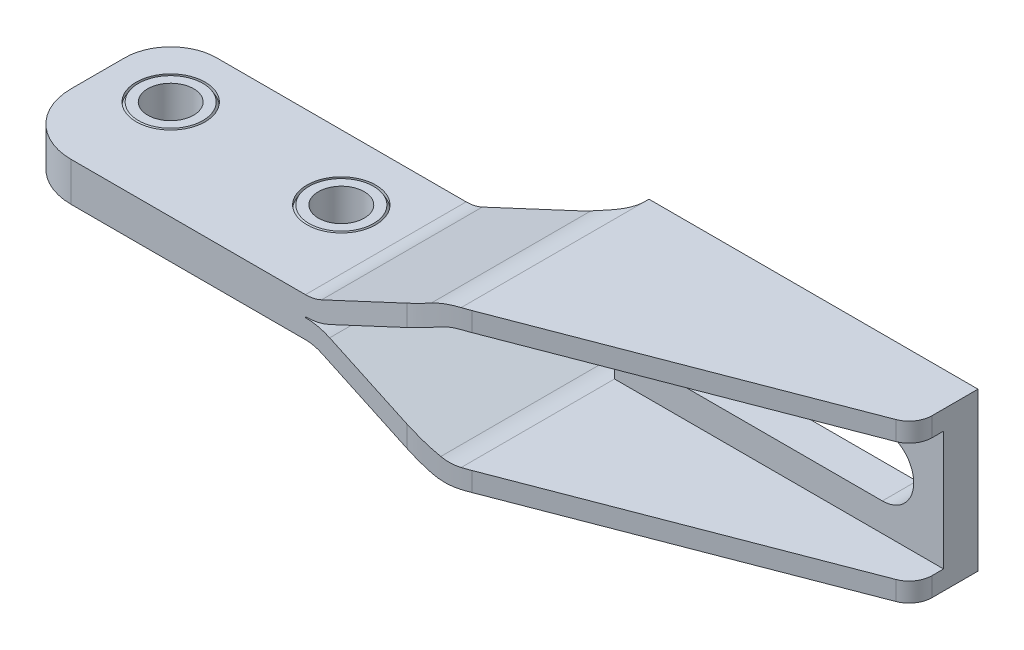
ISO-10303-21;
HEADER;
FILE_DESCRIPTION(('STEP AP214'),'2;1');
FILE_NAME('part.step','',(''),(''),'','','');
FILE_SCHEMA(('AUTOMOTIVE_DESIGN { 1 0 10303 214 1 1 1 1 }'));
ENDSEC;
DATA;
#1=APPLICATION_CONTEXT('core data for automotive mechanical design processes');
#2=APPLICATION_PROTOCOL_DEFINITION('international standard','automotive_design',2000,#1);
#3=PRODUCT_CONTEXT('',#1,'mechanical');
#4=PRODUCT('Part','Part','',(#3));
#5=PRODUCT_RELATED_PRODUCT_CATEGORY('part','',(#4));
#6=PRODUCT_DEFINITION_FORMATION('','',#4);
#7=PRODUCT_DEFINITION_CONTEXT('part definition',#1,'design');
#8=PRODUCT_DEFINITION('design','',#6,#7);
#9=PRODUCT_DEFINITION_SHAPE('','',#8);
#10=(LENGTH_UNIT() NAMED_UNIT(*) SI_UNIT(.MILLI.,.METRE.));
#11=(NAMED_UNIT(*) PLANE_ANGLE_UNIT() SI_UNIT($,.RADIAN.));
#12=(NAMED_UNIT(*) SI_UNIT($,.STERADIAN.) SOLID_ANGLE_UNIT());
#13=UNCERTAINTY_MEASURE_WITH_UNIT(LENGTH_MEASURE(1.E-05),#10,'distance_accuracy_value','');
#14=(GEOMETRIC_REPRESENTATION_CONTEXT(3) GLOBAL_UNCERTAINTY_ASSIGNED_CONTEXT((#13)) GLOBAL_UNIT_ASSIGNED_CONTEXT((#10,
#11,#12)) REPRESENTATION_CONTEXT('',''));
#15=CARTESIAN_POINT('',(0.,0.,0.));
#16=DIRECTION('',(0.,0.,1.));
#17=DIRECTION('',(1.,0.,0.));
#18=AXIS2_PLACEMENT_3D('',#15,#16,#17);
#19=CARTESIAN_POINT('',(22.8,-2.55,0.5));
#20=DIRECTION('',(0.,1.,0.));
#21=DIRECTION('',(1.,0.,0.));
#22=AXIS2_PLACEMENT_3D('',#19,#20,#21);
#23=CYLINDRICAL_SURFACE('',#22,3.);
#24=CARTESIAN_POINT('',(22.8,-2.55,0.5));
#25=DIRECTION('',(0.,1.,0.));
#26=DIRECTION('',(1.,0.,0.));
#27=AXIS2_PLACEMENT_3D('',#24,#25,#26);
#28=CIRCLE('',#27,3.);
#29=CARTESIAN_POINT('',(25.8,-2.55,0.5));
#30=VERTEX_POINT('',#29);
#31=EDGE_CURVE('E302',#30,#30,#28,.T.);
#32=ORIENTED_EDGE('',*,*,#31,.F.);
#33=EDGE_LOOP('',(#32));
#34=FACE_BOUND('',#33,.T.);
#35=CARTESIAN_POINT('',(22.8,2.55,0.5));
#36=DIRECTION('',(0.,1.,0.));
#37=DIRECTION('',(1.,0.,0.));
#38=AXIS2_PLACEMENT_3D('',#35,#36,#37);
#39=CIRCLE('',#38,3.);
#40=CARTESIAN_POINT('',(25.8,2.55,0.5));
#41=VERTEX_POINT('',#40);
#42=EDGE_CURVE('E23',#41,#41,#39,.T.);
#43=ORIENTED_EDGE('',*,*,#42,.T.);
#44=EDGE_LOOP('',(#43));
#45=FACE_BOUND('',#44,.T.);
#46=ADVANCED_FACE('F14',(#34,#45),#23,.F.);
#47=CARTESIAN_POINT('',(22.8,-2.55,-2.5));
#48=DIRECTION('',(0.,1.,0.));
#49=DIRECTION('',(1.,0.,0.));
#50=AXIS2_PLACEMENT_3D('',#47,#48,#49);
#51=PLANE('',#50);
#52=CARTESIAN_POINT('',(22.8,-2.55,0.5));
#53=DIRECTION('',(0.,1.,0.));
#54=DIRECTION('',(1.,0.,0.));
#55=AXIS2_PLACEMENT_3D('',#52,#53,#54);
#56=CIRCLE('',#55,4.2113248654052);
#57=CARTESIAN_POINT('',(27.0113248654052,-2.55,0.5));
#58=VERTEX_POINT('',#57);
#59=EDGE_CURVE('E299',#58,#58,#56,.T.);
#60=ORIENTED_EDGE('',*,*,#59,.F.);
#61=EDGE_LOOP('',(#60));
#62=FACE_BOUND('',#61,.T.);
#63=ORIENTED_EDGE('',*,*,#31,.T.);
#64=EDGE_LOOP('',(#63));
#65=FACE_BOUND('',#64,.T.);
#66=ADVANCED_FACE('F1493',(#62,#65),#51,.F.);
#67=CARTESIAN_POINT('',(22.8,-2.55,0.5));
#68=DIRECTION('',(0.,1.,0.));
#69=DIRECTION('',(1.,0.,0.));
#70=AXIS2_PLACEMENT_3D('',#67,#68,#69);
#71=CONICAL_SURFACE('',#70,4.2113248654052,0.523598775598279);
#72=CARTESIAN_POINT('',(22.8,-2.05,0.5));
#73=DIRECTION('',(0.,1.,0.));
#74=DIRECTION('',(1.,0.,0.));
#75=AXIS2_PLACEMENT_3D('',#72,#73,#74);
#76=CIRCLE('',#75,4.5);
#77=CARTESIAN_POINT('',(27.3,-2.05,0.5));
#78=VERTEX_POINT('',#77);
#79=EDGE_CURVE('E295',#78,#78,#76,.T.);
#80=ORIENTED_EDGE('',*,*,#79,.F.);
#81=EDGE_LOOP('',(#80));
#82=FACE_BOUND('',#81,.T.);
#83=ORIENTED_EDGE('',*,*,#59,.T.);
#84=EDGE_LOOP('',(#83));
#85=FACE_BOUND('',#84,.T.);
#86=ADVANCED_FACE('F1488',(#82,#85),#71,.T.);
#87=CARTESIAN_POINT('',(22.8,2.55,-3.7113248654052));
#88=DIRECTION('',(0.,-1.,0.));
#89=DIRECTION('',(-1.,0.,0.));
#90=AXIS2_PLACEMENT_3D('',#87,#88,#89);
#91=PLANE('',#90);
#92=ORIENTED_EDGE('',*,*,#42,.F.);
#93=EDGE_LOOP('',(#92));
#94=FACE_BOUND('',#93,.T.);
#95=CARTESIAN_POINT('',(22.8,2.55,0.5));
#96=DIRECTION('',(0.,1.,0.));
#97=DIRECTION('',(1.,0.,0.));
#98=AXIS2_PLACEMENT_3D('',#95,#96,#97);
#99=CIRCLE('',#98,4.2113248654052);
#100=CARTESIAN_POINT('',(27.0113248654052,2.55,0.5));
#101=VERTEX_POINT('',#100);
#102=EDGE_CURVE('E9',#101,#101,#99,.T.);
#103=ORIENTED_EDGE('',*,*,#102,.T.);
#104=EDGE_LOOP('',(#103));
#105=FACE_BOUND('',#104,.T.);
#106=ADVANCED_FACE('F886',(#94,#105),#91,.F.);
#107=CARTESIAN_POINT('',(22.8,2.05,0.5));
#108=DIRECTION('',(0.,-1.,0.));
#109=DIRECTION('',(-1.,0.,0.));
#110=AXIS2_PLACEMENT_3D('',#107,#108,#109);
#111=CONICAL_SURFACE('',#110,4.5,0.52359877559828);
#112=ORIENTED_EDGE('',*,*,#102,.F.);
#113=EDGE_LOOP('',(#112));
#114=FACE_BOUND('',#113,.T.);
#115=CARTESIAN_POINT('',(22.8,2.05,0.5));
#116=DIRECTION('',(0.,1.,0.));
#117=DIRECTION('',(1.,0.,0.));
#118=AXIS2_PLACEMENT_3D('',#115,#116,#117);
#119=CIRCLE('',#118,4.5);
#120=CARTESIAN_POINT('',(27.3,2.05,0.5));
#121=VERTEX_POINT('',#120);
#122=EDGE_CURVE('E292',#121,#121,#119,.T.);
#123=ORIENTED_EDGE('',*,*,#122,.T.);
#124=EDGE_LOOP('',(#123));
#125=FACE_BOUND('',#124,.T.);
#126=ADVANCED_FACE('F877',(#114,#125),#111,.T.);
#127=CARTESIAN_POINT('',(0.,-2.55,0.));
#128=DIRECTION('',(0.,1.,0.));
#129=DIRECTION('',(1.,0.,0.));
#130=AXIS2_PLACEMENT_3D('',#127,#128,#129);
#131=CYLINDRICAL_SURFACE('',#130,3.);
#132=CARTESIAN_POINT('',(0.,-2.55,0.));
#133=DIRECTION('',(0.,1.,0.));
#134=DIRECTION('',(1.,0.,0.));
#135=AXIS2_PLACEMENT_3D('',#132,#133,#134);
#136=CIRCLE('',#135,3.);
#137=CARTESIAN_POINT('',(3.,-2.55,0.));
#138=VERTEX_POINT('',#137);
#139=EDGE_CURVE('E316',#138,#138,#136,.T.);
#140=ORIENTED_EDGE('',*,*,#139,.F.);
#141=EDGE_LOOP('',(#140));
#142=FACE_BOUND('',#141,.T.);
#143=CARTESIAN_POINT('',(0.,2.55,0.));
#144=DIRECTION('',(0.,1.,0.));
#145=DIRECTION('',(1.,0.,0.));
#146=AXIS2_PLACEMENT_3D('',#143,#144,#145);
#147=CIRCLE('',#146,3.);
#148=CARTESIAN_POINT('',(3.,2.55,0.));
#149=VERTEX_POINT('',#148);
#150=EDGE_CURVE('E319',#149,#149,#147,.T.);
#151=ORIENTED_EDGE('',*,*,#150,.T.);
#152=EDGE_LOOP('',(#151));
#153=FACE_BOUND('',#152,.T.);
#154=ADVANCED_FACE('F864',(#142,#153),#131,.F.);
#155=CARTESIAN_POINT('',(85.,0.,-12.5));
#156=DIRECTION('',(0.,0.,1.));
#157=DIRECTION('',(0.,1.,0.));
#158=AXIS2_PLACEMENT_3D('',#155,#156,#157);
#159=CYLINDRICAL_SURFACE('',#158,4.1);
#160=CARTESIAN_POINT('',(85.,0.,-8.));
#161=DIRECTION('',(0.,0.,1.));
#162=DIRECTION('',(-1.,0.,0.));
#163=AXIS2_PLACEMENT_3D('',#160,#161,#162);
#164=CIRCLE('',#163,4.1);
#165=CARTESIAN_POINT('',(85.,-4.1,-8.));
#166=VERTEX_POINT('',#165);
#167=CARTESIAN_POINT('',(85.,4.1,-8.));
#168=VERTEX_POINT('',#167);
#169=EDGE_CURVE('E336',#166,#168,#164,.T.);
#170=ORIENTED_EDGE('',*,*,#169,.T.);
#171=DIRECTION('',(0.,0.,1.));
#172=VECTOR('',#171,1.);
#173=CARTESIAN_POINT('',(85.,4.1,-12.5));
#174=LINE('',#173,#172);
#175=CARTESIAN_POINT('',(85.,4.1,-12.5));
#176=VERTEX_POINT('',#175);
#177=EDGE_CURVE('E363',#176,#168,#174,.T.);
#178=ORIENTED_EDGE('',*,*,#177,.F.);
#179=CARTESIAN_POINT('',(85.,0.,-12.5));
#180=DIRECTION('',(0.,0.,1.));
#181=DIRECTION('',(-1.,0.,0.));
#182=AXIS2_PLACEMENT_3D('',#179,#180,#181);
#183=CIRCLE('',#182,4.1);
#184=CARTESIAN_POINT('',(85.,-4.1,-12.5));
#185=VERTEX_POINT('',#184);
#186=EDGE_CURVE('E349',#185,#176,#183,.T.);
#187=ORIENTED_EDGE('',*,*,#186,.F.);
#188=DIRECTION('',(0.,0.,1.));
#189=VECTOR('',#188,1.);
#190=CARTESIAN_POINT('',(85.,-4.1,-12.5));
#191=LINE('',#190,#189);
#192=EDGE_CURVE('E365',#185,#166,#191,.T.);
#193=ORIENTED_EDGE('',*,*,#192,.T.);
#194=EDGE_LOOP('',(#170,#178,#187,#193));
#195=FACE_BOUND('',#194,.T.);
#196=ADVANCED_FACE('F872',(#195),#159,.F.);
#197=CARTESIAN_POINT('',(85.,4.1,-12.5));
#198=DIRECTION('',(0.,1.,0.));
#199=DIRECTION('',(-1.,0.,0.));
#200=AXIS2_PLACEMENT_3D('',#197,#198,#199);
#201=PLANE('',#200);
#202=DIRECTION('',(-1.,0.,0.));
#203=VECTOR('',#202,1.);
#204=CARTESIAN_POINT('',(85.,4.1,-8.));
#205=LINE('',#204,#203);
#206=CARTESIAN_POINT('',(58.,4.1,-8.));
#207=VERTEX_POINT('',#206);
#208=EDGE_CURVE('E39',#168,#207,#205,.T.);
#209=ORIENTED_EDGE('',*,*,#208,.T.);
#210=DIRECTION('',(0.,0.,1.));
#211=VECTOR('',#210,1.);
#212=CARTESIAN_POINT('',(58.,4.1,-12.5));
#213=LINE('',#212,#211);
#214=CARTESIAN_POINT('',(58.,4.1,-12.5));
#215=VERTEX_POINT('',#214);
#216=EDGE_CURVE('E361',#215,#207,#213,.T.);
#217=ORIENTED_EDGE('',*,*,#216,.F.);
#218=DIRECTION('',(-1.,0.,0.));
#219=VECTOR('',#218,1.);
#220=CARTESIAN_POINT('',(85.,4.1,-12.5));
#221=LINE('',#220,#219);
#222=EDGE_CURVE('E352',#176,#215,#221,.T.);
#223=ORIENTED_EDGE('',*,*,#222,.F.);
#224=ORIENTED_EDGE('',*,*,#177,.T.);
#225=EDGE_LOOP('',(#209,#217,#223,#224));
#226=FACE_BOUND('',#225,.T.);
#227=ADVANCED_FACE('F884',(#226),#201,.F.);
#228=CARTESIAN_POINT('',(58.,0.,-12.5));
#229=DIRECTION('',(0.,0.,1.));
#230=DIRECTION('',(0.,1.,0.));
#231=AXIS2_PLACEMENT_3D('',#228,#229,#230);
#232=CYLINDRICAL_SURFACE('',#231,4.1);
#233=CARTESIAN_POINT('',(58.,0.,-8.));
#234=DIRECTION('',(0.,0.,1.));
#235=DIRECTION('',(1.,0.,0.));
#236=AXIS2_PLACEMENT_3D('',#233,#234,#235);
#237=CIRCLE('',#236,4.1);
#238=CARTESIAN_POINT('',(58.,-4.1,-8.));
#239=VERTEX_POINT('',#238);
#240=EDGE_CURVE('E342',#207,#239,#237,.T.);
#241=ORIENTED_EDGE('',*,*,#240,.T.);
#242=DIRECTION('',(0.,0.,1.));
#243=VECTOR('',#242,1.);
#244=CARTESIAN_POINT('',(58.,-4.1,-12.5));
#245=LINE('',#244,#243);
#246=CARTESIAN_POINT('',(58.,-4.1,-12.5));
#247=VERTEX_POINT('',#246);
#248=EDGE_CURVE('E358',#247,#239,#245,.T.);
#249=ORIENTED_EDGE('',*,*,#248,.F.);
#250=CARTESIAN_POINT('',(58.,0.,-12.5));
#251=DIRECTION('',(0.,0.,1.));
#252=DIRECTION('',(1.,0.,0.));
#253=AXIS2_PLACEMENT_3D('',#250,#251,#252);
#254=CIRCLE('',#253,4.1);
#255=EDGE_CURVE('E355',#215,#247,#254,.T.);
#256=ORIENTED_EDGE('',*,*,#255,.F.);
#257=ORIENTED_EDGE('',*,*,#216,.T.);
#258=EDGE_LOOP('',(#241,#249,#256,#257));
#259=FACE_BOUND('',#258,.T.);
#260=ADVANCED_FACE('F871',(#259),#232,.F.);
#261=CARTESIAN_POINT('',(58.,-4.1,-12.5));
#262=DIRECTION('',(0.,-1.,0.));
#263=DIRECTION('',(1.,0.,0.));
#264=AXIS2_PLACEMENT_3D('',#261,#262,#263);
#265=PLANE('',#264);
#266=DIRECTION('',(1.,0.,0.));
#267=VECTOR('',#266,1.);
#268=CARTESIAN_POINT('',(58.,-4.1,-8.));
#269=LINE('',#268,#267);
#270=EDGE_CURVE('E335',#239,#166,#269,.T.);
#271=ORIENTED_EDGE('',*,*,#270,.T.);
#272=ORIENTED_EDGE('',*,*,#192,.F.);
#273=DIRECTION('',(1.,0.,0.));
#274=VECTOR('',#273,1.);
#275=CARTESIAN_POINT('',(58.,-4.1,-12.5));
#276=LINE('',#275,#274);
#277=EDGE_CURVE('E31',#247,#185,#276,.T.);
#278=ORIENTED_EDGE('',*,*,#277,.F.);
#279=ORIENTED_EDGE('',*,*,#248,.T.);
#280=EDGE_LOOP('',(#271,#272,#278,#279));
#281=FACE_BOUND('',#280,.T.);
#282=ADVANCED_FACE('F401',(#281),#265,.F.);
#283=CARTESIAN_POINT('',(0.,2.55,-4.2113248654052));
#284=DIRECTION('',(0.,-1.,0.));
#285=DIRECTION('',(-1.,0.,0.));
#286=AXIS2_PLACEMENT_3D('',#283,#284,#285);
#287=PLANE('',#286);
#288=ORIENTED_EDGE('',*,*,#150,.F.);
#289=EDGE_LOOP('',(#288));
#290=FACE_BOUND('',#289,.T.);
#291=CARTESIAN_POINT('',(0.,2.55,0.));
#292=DIRECTION('',(0.,1.,0.));
#293=DIRECTION('',(1.,0.,0.));
#294=AXIS2_PLACEMENT_3D('',#291,#292,#293);
#295=CIRCLE('',#294,4.2113248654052);
#296=CARTESIAN_POINT('',(4.2113248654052,2.55,0.));
#297=VERTEX_POINT('',#296);
#298=EDGE_CURVE('E296',#297,#297,#295,.T.);
#299=ORIENTED_EDGE('',*,*,#298,.T.);
#300=EDGE_LOOP('',(#299));
#301=FACE_BOUND('',#300,.T.);
#302=ADVANCED_FACE('F850',(#290,#301),#287,.F.);
#303=CARTESIAN_POINT('',(90.,-10.3,-6.50000000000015));
#304=DIRECTION('',(0.,1.,0.));
#305=DIRECTION('',(-1.,0.,0.));
#306=AXIS2_PLACEMENT_3D('',#303,#304,#305);
#307=CYLINDRICAL_SURFACE('',#306,3.00000000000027);
#308=DIRECTION('',(0.,1.,0.));
#309=VECTOR('',#308,1.);
#310=CARTESIAN_POINT('',(91.075103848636,-10.3,-3.6992587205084));
#311=LINE('',#310,#309);
#312=CARTESIAN_POINT('',(91.075103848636,7.8,-3.6992587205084));
#313=VERTEX_POINT('',#312);
#314=CARTESIAN_POINT('',(91.075103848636,10.3,-3.6992587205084));
#315=VERTEX_POINT('',#314);
#316=EDGE_CURVE('E591',#313,#315,#311,.T.);
#317=ORIENTED_EDGE('',*,*,#316,.F.);
#318=CARTESIAN_POINT('',(90.,7.8,-6.50000000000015));
#319=DIRECTION('',(0.,-1.,0.));
#320=DIRECTION('',(1.,0.,0.));
#321=AXIS2_PLACEMENT_3D('',#318,#319,#320);
#322=CIRCLE('',#321,3.00000000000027);
#323=CARTESIAN_POINT('',(93.,7.8,-6.5));
#324=VERTEX_POINT('',#323);
#325=EDGE_CURVE('E641',#313,#324,#322,.F.);
#326=ORIENTED_EDGE('',*,*,#325,.T.);
#327=DIRECTION('',(0.,1.,0.));
#328=VECTOR('',#327,1.);
#329=CARTESIAN_POINT('',(93.,-10.3,-6.5));
#330=LINE('',#329,#328);
#331=CARTESIAN_POINT('',(93.,10.3,-6.5));
#332=VERTEX_POINT('',#331);
#333=EDGE_CURVE('E585',#324,#332,#330,.T.);
#334=ORIENTED_EDGE('',*,*,#333,.T.);
#335=CARTESIAN_POINT('',(90.,10.3,-6.50000000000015));
#336=DIRECTION('',(0.,1.,0.));
#337=DIRECTION('',(-1.,0.,0.));
#338=AXIS2_PLACEMENT_3D('',#335,#336,#337);
#339=CIRCLE('',#338,3.00000000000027);
#340=EDGE_CURVE('E565',#315,#332,#339,.T.);
#341=ORIENTED_EDGE('',*,*,#340,.F.);
#342=EDGE_LOOP('',(#317,#326,#334,#341));
#343=FACE_BOUND('',#342,.T.);
#344=ADVANCED_FACE('F832',(#343),#307,.T.);
#345=CARTESIAN_POINT('',(0.,-2.55,-3.));
#346=DIRECTION('',(0.,1.,0.));
#347=DIRECTION('',(1.,0.,0.));
#348=AXIS2_PLACEMENT_3D('',#345,#346,#347);
#349=PLANE('',#348);
#350=CARTESIAN_POINT('',(0.,-2.55,0.));
#351=DIRECTION('',(0.,1.,0.));
#352=DIRECTION('',(1.,0.,0.));
#353=AXIS2_PLACEMENT_3D('',#350,#351,#352);
#354=CIRCLE('',#353,4.2113248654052);
#355=CARTESIAN_POINT('',(4.2113248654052,-2.55,0.));
#356=VERTEX_POINT('',#355);
#357=EDGE_CURVE('E313',#356,#356,#354,.T.);
#358=ORIENTED_EDGE('',*,*,#357,.F.);
#359=EDGE_LOOP('',(#358));
#360=FACE_BOUND('',#359,.T.);
#361=ORIENTED_EDGE('',*,*,#139,.T.);
#362=EDGE_LOOP('',(#361));
#363=FACE_BOUND('',#362,.T.);
#364=ADVANCED_FACE('F849',(#360,#363),#349,.F.);
#365=CARTESIAN_POINT('',(93.,-10.3,-12.5));
#366=DIRECTION('',(0.,0.,-1.));
#367=DIRECTION('',(0.,-1.,0.));
#368=AXIS2_PLACEMENT_3D('',#365,#366,#367);
#369=PLANE('',#368);
#370=ORIENTED_EDGE('',*,*,#277,.T.);
#371=ORIENTED_EDGE('',*,*,#186,.T.);
#372=ORIENTED_EDGE('',*,*,#222,.T.);
#373=ORIENTED_EDGE('',*,*,#255,.T.);
#374=EDGE_LOOP('',(#370,#371,#372,#373));
#375=FACE_BOUND('',#374,.T.);
#376=DIRECTION('',(0.,1.,0.));
#377=VECTOR('',#376,1.);
#378=CARTESIAN_POINT('',(50.,-10.3,-12.5));
#379=LINE('',#378,#377);
#380=CARTESIAN_POINT('',(50.,-10.3,-12.5));
#381=VERTEX_POINT('',#380);
#382=CARTESIAN_POINT('',(50.,10.3,-12.5));
#383=VERTEX_POINT('',#382);
#384=EDGE_CURVE('E619',#381,#383,#379,.T.);
#385=ORIENTED_EDGE('',*,*,#384,.T.);
#386=DIRECTION('',(-1.,0.,0.));
#387=VECTOR('',#386,1.);
#388=CARTESIAN_POINT('',(93.,10.3,-12.5));
#389=LINE('',#388,#387);
#390=CARTESIAN_POINT('',(93.,10.3,-12.5));
#391=VERTEX_POINT('',#390);
#392=EDGE_CURVE('E553',#391,#383,#389,.T.);
#393=ORIENTED_EDGE('',*,*,#392,.F.);
#394=DIRECTION('',(0.,1.,0.));
#395=VECTOR('',#394,1.);
#396=CARTESIAN_POINT('',(93.,-10.3,-12.5));
#397=LINE('',#396,#395);
#398=CARTESIAN_POINT('',(93.,-10.3,-12.5));
#399=VERTEX_POINT('',#398);
#400=EDGE_CURVE('E621',#399,#391,#397,.T.);
#401=ORIENTED_EDGE('',*,*,#400,.F.);
#402=DIRECTION('',(-1.,0.,0.));
#403=VECTOR('',#402,1.);
#404=CARTESIAN_POINT('',(93.,-10.3,-12.5));
#405=LINE('',#404,#403);
#406=EDGE_CURVE('E571',#399,#381,#405,.T.);
#407=ORIENTED_EDGE('',*,*,#406,.T.);
#408=EDGE_LOOP('',(#385,#393,#401,#407));
#409=FACE_BOUND('',#408,.T.);
#410=ADVANCED_FACE('F408',(#375,#409),#369,.T.);
#411=CARTESIAN_POINT('',(50.,2.80000000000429,-8.));
#412=DIRECTION('',(0.,0.,1.));
#413=DIRECTION('',(0.,1.,0.));
#414=AXIS2_PLACEMENT_3D('',#411,#412,#413);
#415=PLANE('',#414);
#416=ORIENTED_EDGE('',*,*,#270,.F.);
#417=ORIENTED_EDGE('',*,*,#240,.F.);
#418=ORIENTED_EDGE('',*,*,#208,.F.);
#419=ORIENTED_EDGE('',*,*,#169,.F.);
#420=EDGE_LOOP('',(#416,#417,#418,#419));
#421=FACE_BOUND('',#420,.T.);
#422=DIRECTION('',(0.,1.,0.));
#423=VECTOR('',#422,1.);
#424=CARTESIAN_POINT('',(50.,-7.8,-8.));
#425=LINE('',#424,#423);
#426=CARTESIAN_POINT('',(50.,-7.8,-8.));
#427=VERTEX_POINT('',#426);
#428=CARTESIAN_POINT('',(50.,7.8,-8.));
#429=VERTEX_POINT('',#428);
#430=EDGE_CURVE('E367',#427,#429,#425,.T.);
#431=ORIENTED_EDGE('',*,*,#430,.F.);
#432=DIRECTION('',(1.,0.,0.));
#433=VECTOR('',#432,1.);
#434=CARTESIAN_POINT('',(50.,-7.8,-8.));
#435=LINE('',#434,#433);
#436=CARTESIAN_POINT('',(93.,-7.8,-8.));
#437=VERTEX_POINT('',#436);
#438=EDGE_CURVE('E660',#427,#437,#435,.T.);
#439=ORIENTED_EDGE('',*,*,#438,.T.);
#440=DIRECTION('',(0.,-1.,0.));
#441=VECTOR('',#440,1.);
#442=CARTESIAN_POINT('',(93.,-10.3,-8.));
#443=LINE('',#442,#441);
#444=CARTESIAN_POINT('',(93.,7.8,-8.));
#445=VERTEX_POINT('',#444);
#446=EDGE_CURVE('E431',#445,#437,#443,.T.);
#447=ORIENTED_EDGE('',*,*,#446,.F.);
#448=DIRECTION('',(-1.,0.,0.));
#449=VECTOR('',#448,1.);
#450=CARTESIAN_POINT('',(98.,7.8,-8.));
#451=LINE('',#450,#449);
#452=EDGE_CURVE('E658',#445,#429,#451,.T.);
#453=ORIENTED_EDGE('',*,*,#452,.T.);
#454=EDGE_LOOP('',(#431,#439,#447,#453));
#455=FACE_BOUND('',#454,.T.);
#456=ADVANCED_FACE('F405',(#421,#455),#415,.T.);
#457=CARTESIAN_POINT('',(93.,-10.3,-6.5));
#458=DIRECTION('',(1.,0.,0.));
#459=DIRECTION('',(0.,1.,0.));
#460=AXIS2_PLACEMENT_3D('',#457,#458,#459);
#461=PLANE('',#460);
#462=ORIENTED_EDGE('',*,*,#446,.T.);
#463=DIRECTION('',(0.,0.,1.));
#464=VECTOR('',#463,1.);
#465=CARTESIAN_POINT('',(93.,-7.8,-6.5));
#466=LINE('',#465,#464);
#467=CARTESIAN_POINT('',(93.,-7.8,-6.5));
#468=VERTEX_POINT('',#467);
#469=EDGE_CURVE('E650',#437,#468,#466,.T.);
#470=ORIENTED_EDGE('',*,*,#469,.T.);
#471=CARTESIAN_POINT('',(93.,-10.3,-6.5));
#472=VERTEX_POINT('',#471);
#473=EDGE_CURVE('E588',#472,#468,#330,.T.);
#474=ORIENTED_EDGE('',*,*,#473,.F.);
#475=DIRECTION('',(0.,0.,-1.));
#476=VECTOR('',#475,1.);
#477=CARTESIAN_POINT('',(93.,-10.3,-6.5));
#478=LINE('',#477,#476);
#479=EDGE_CURVE('E568',#472,#399,#478,.T.);
#480=ORIENTED_EDGE('',*,*,#479,.T.);
#481=ORIENTED_EDGE('',*,*,#400,.T.);
#482=DIRECTION('',(0.,0.,-1.));
#483=VECTOR('',#482,1.);
#484=CARTESIAN_POINT('',(93.,10.3,-6.5));
#485=LINE('',#484,#483);
#486=EDGE_CURVE('E552',#332,#391,#485,.T.);
#487=ORIENTED_EDGE('',*,*,#486,.F.);
#488=ORIENTED_EDGE('',*,*,#333,.F.);
#489=DIRECTION('',(0.,0.,-1.));
#490=VECTOR('',#489,1.);
#491=CARTESIAN_POINT('',(93.,7.8,-6.5));
#492=LINE('',#491,#490);
#493=EDGE_CURVE('E652',#324,#445,#492,.T.);
#494=ORIENTED_EDGE('',*,*,#493,.T.);
#495=EDGE_LOOP('',(#462,#470,#474,#480,#481,#487,#488,#494));
#496=FACE_BOUND('',#495,.T.);
#497=ADVANCED_FACE('F16',(#496),#461,.T.);
#498=ORIENTED_EDGE('',*,*,#473,.T.);
#499=CARTESIAN_POINT('',(90.,-7.8,-6.50000000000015));
#500=DIRECTION('',(0.,1.,0.));
#501=DIRECTION('',(-1.,0.,0.));
#502=AXIS2_PLACEMENT_3D('',#499,#500,#501);
#503=CIRCLE('',#502,3.00000000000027);
#504=CARTESIAN_POINT('',(91.075103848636,-7.8,-3.6992587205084));
#505=VERTEX_POINT('',#504);
#506=EDGE_CURVE('E643',#468,#505,#503,.F.);
#507=ORIENTED_EDGE('',*,*,#506,.T.);
#508=CARTESIAN_POINT('',(91.075103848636,-10.3,-3.6992587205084));
#509=VERTEX_POINT('',#508);
#510=EDGE_CURVE('E592',#509,#505,#311,.T.);
#511=ORIENTED_EDGE('',*,*,#510,.F.);
#512=CARTESIAN_POINT('',(90.,-10.3,-6.50000000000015));
#513=DIRECTION('',(0.,1.,0.));
#514=DIRECTION('',(-1.,0.,0.));
#515=AXIS2_PLACEMENT_3D('',#512,#513,#514);
#516=CIRCLE('',#515,3.00000000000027);
#517=EDGE_CURVE('E582',#509,#472,#516,.T.);
#518=ORIENTED_EDGE('',*,*,#517,.T.);
#519=EDGE_LOOP('',(#498,#507,#511,#518));
#520=FACE_BOUND('',#519,.T.);
#521=ADVANCED_FACE('F795',(#520),#307,.T.);
#522=CARTESIAN_POINT('',(0.,2.05,0.));
#523=DIRECTION('',(0.,-1.,0.));
#524=DIRECTION('',(-1.,0.,0.));
#525=AXIS2_PLACEMENT_3D('',#522,#523,#524);
#526=CONICAL_SURFACE('',#525,4.5,0.52359877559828);
#527=ORIENTED_EDGE('',*,*,#298,.F.);
#528=EDGE_LOOP('',(#527));
#529=FACE_BOUND('',#528,.T.);
#530=CARTESIAN_POINT('',(0.,2.05,0.));
#531=DIRECTION('',(0.,1.,0.));
#532=DIRECTION('',(1.,0.,0.));
#533=AXIS2_PLACEMENT_3D('',#530,#531,#532);
#534=CIRCLE('',#533,4.5);
#535=CARTESIAN_POINT('',(4.5,2.05,0.));
#536=VERTEX_POINT('',#535);
#537=EDGE_CURVE('E307',#536,#536,#534,.T.);
#538=ORIENTED_EDGE('',*,*,#537,.T.);
#539=EDGE_LOOP('',(#538));
#540=FACE_BOUND('',#539,.T.);
#541=ADVANCED_FACE('F846',(#529,#540),#526,.T.);
#542=CARTESIAN_POINT('',(46.,10.3,-12.0000000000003));
#543=DIRECTION('',(0.,-1.,0.));
#544=DIRECTION('',(1.,0.,0.));
#545=AXIS2_PLACEMENT_3D('',#542,#543,#544);
#546=PLANE('',#545);
#547=DIRECTION('',(0.,0.,-1.));
#548=VECTOR('',#547,1.);
#549=CARTESIAN_POINT('',(50.,10.3,15.));
#550=LINE('',#549,#548);
#551=CARTESIAN_POINT('',(49.9999999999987,10.3,12.0358883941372));
#552=VERTEX_POINT('',#551);
#553=CARTESIAN_POINT('',(50.,10.3,-12.));
#554=VERTEX_POINT('',#553);
#555=EDGE_CURVE('E710',#552,#554,#550,.T.);
#556=ORIENTED_EDGE('',*,*,#555,.F.);
#557=CARTESIAN_POINT('',(43.8652666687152,10.3,-7.00000000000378));
#558=DIRECTION('',(0.,1.,0.));
#559=DIRECTION('',(-1.,0.,0.));
#560=AXIS2_PLACEMENT_3D('',#557,#558,#559);
#561=CIRCLE('',#560,20.0000000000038);
#562=CARTESIAN_POINT('',(51.032625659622,10.3,11.671608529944));
#563=VERTEX_POINT('',#562);
#564=EDGE_CURVE('E559',#552,#563,#561,.T.);
#565=ORIENTED_EDGE('',*,*,#564,.T.);
#566=DIRECTION('',(0.933580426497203,0.,-0.358367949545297));
#567=VECTOR('',#566,1.);
#568=CARTESIAN_POINT('',(51.032625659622,10.3,11.671608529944));
#569=LINE('',#568,#567);
#570=EDGE_CURVE('E562',#563,#315,#569,.T.);
#571=ORIENTED_EDGE('',*,*,#570,.T.);
#572=ORIENTED_EDGE('',*,*,#340,.T.);
#573=ORIENTED_EDGE('',*,*,#486,.T.);
#574=ORIENTED_EDGE('',*,*,#392,.T.);
#575=DIRECTION('',(0.,0.,1.));
#576=VECTOR('',#575,1.);
#577=CARTESIAN_POINT('',(50.,10.3,-12.5));
#578=LINE('',#577,#576);
#579=EDGE_CURVE('E556',#383,#554,#578,.T.);
#580=ORIENTED_EDGE('',*,*,#579,.T.);
#581=EDGE_LOOP('',(#556,#565,#571,#572,#573,#574,#580));
#582=FACE_BOUND('',#581,.T.);
#583=ADVANCED_FACE('F518',(#582),#546,.F.);
#584=CARTESIAN_POINT('',(51.032625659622,-10.3,11.671608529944));
#585=DIRECTION('',(0.358367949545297,0.,0.933580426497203));
#586=DIRECTION('',(0.933580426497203,0.,-0.358367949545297));
#587=AXIS2_PLACEMENT_3D('',#584,#585,#586);
#588=PLANE('',#587);
#589=DIRECTION('',(0.,1.,0.));
#590=VECTOR('',#589,1.);
#591=CARTESIAN_POINT('',(51.032625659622,-10.3,11.671608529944));
#592=LINE('',#591,#590);
#593=CARTESIAN_POINT('',(51.032625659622,7.8,11.671608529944));
#594=VERTEX_POINT('',#593);
#595=EDGE_CURVE('E595',#594,#563,#592,.T.);
#596=ORIENTED_EDGE('',*,*,#595,.F.);
#597=DIRECTION('',(0.933580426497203,0.,-0.358367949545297));
#598=VECTOR('',#597,1.);
#599=CARTESIAN_POINT('',(51.032625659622,7.8,11.671608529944));
#600=LINE('',#599,#598);
#601=EDGE_CURVE('E690',#594,#313,#600,.T.);
#602=ORIENTED_EDGE('',*,*,#601,.T.);
#603=ORIENTED_EDGE('',*,*,#316,.T.);
#604=ORIENTED_EDGE('',*,*,#570,.F.);
#605=EDGE_LOOP('',(#596,#602,#603,#604));
#606=FACE_BOUND('',#605,.T.);
#607=ADVANCED_FACE('F788',(#606),#588,.T.);
#608=CARTESIAN_POINT('',(98.,7.8,23.));
#609=DIRECTION('',(0.,-1.,0.));
#610=DIRECTION('',(1.,0.,0.));
#611=AXIS2_PLACEMENT_3D('',#608,#609,#610);
#612=PLANE('',#611);
#613=DIRECTION('',(0.,0.,-1.));
#614=VECTOR('',#613,1.);
#615=CARTESIAN_POINT('',(50.,7.8,23.));
#616=LINE('',#615,#614);
#617=CARTESIAN_POINT('',(50.,7.8,12.0358883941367));
#618=VERTEX_POINT('',#617);
#619=EDGE_CURVE('E664',#618,#429,#616,.T.);
#620=ORIENTED_EDGE('',*,*,#619,.T.);
#621=ORIENTED_EDGE('',*,*,#452,.F.);
#622=ORIENTED_EDGE('',*,*,#493,.F.);
#623=ORIENTED_EDGE('',*,*,#325,.F.);
#624=ORIENTED_EDGE('',*,*,#601,.F.);
#625=CARTESIAN_POINT('',(43.8652666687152,7.8,-7.00000000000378));
#626=DIRECTION('',(0.,-1.,0.));
#627=DIRECTION('',(1.,0.,0.));
#628=AXIS2_PLACEMENT_3D('',#625,#626,#627);
#629=CIRCLE('',#628,20.0000000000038);
#630=EDGE_CURVE('E694',#618,#594,#629,.F.);
#631=ORIENTED_EDGE('',*,*,#630,.F.);
#632=EDGE_LOOP('',(#620,#621,#622,#623,#624,#631));
#633=FACE_BOUND('',#632,.T.);
#634=ADVANCED_FACE('F483',(#633),#612,.T.);
#635=CARTESIAN_POINT('',(49.9999999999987,2.80000000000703,15.));
#636=DIRECTION('',(0.,0.,-1.));
#637=DIRECTION('',(0.,-1.,0.));
#638=AXIS2_PLACEMENT_3D('',#635,#636,#637);
#639=CYLINDRICAL_SURFACE('',#638,7.49999999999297);
#640=DIRECTION('',(0.,0.,-1.));
#641=VECTOR('',#640,1.);
#642=CARTESIAN_POINT('',(46.830157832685,9.5972127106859,15.));
#643=LINE('',#642,#641);
#644=CARTESIAN_POINT('',(46.830157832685,9.5972127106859,12.7790146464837));
#645=VERTEX_POINT('',#644);
#646=CARTESIAN_POINT('',(46.830157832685,9.5972127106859,-8.08709341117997));
#647=VERTEX_POINT('',#646);
#648=EDGE_CURVE('E713',#645,#647,#643,.T.);
#649=ORIENTED_EDGE('',*,*,#648,.F.);
#650=CARTESIAN_POINT('',(50.,10.3,12.0358883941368));
#651=CARTESIAN_POINT('',(49.802769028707,10.3000279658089,12.0994817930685));
#652=CARTESIAN_POINT('',(49.6045004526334,10.292220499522,12.1599640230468));
#653=CARTESIAN_POINT('',(49.2072223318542,10.2606386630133,12.2744897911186));
#654=CARTESIAN_POINT('',(49.0082123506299,10.236852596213,12.3285285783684));
#655=CARTESIAN_POINT('',(48.6149092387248,10.1736323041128,12.4288798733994));
#656=CARTESIAN_POINT('',(48.4205991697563,10.1345087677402,12.4753213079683));
#657=CARTESIAN_POINT('',(48.0344438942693,10.0405823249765,12.5616218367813));
#658=CARTESIAN_POINT('',(47.8425971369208,9.98578984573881,12.6014852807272));
#659=CARTESIAN_POINT('',(47.5136116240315,9.87738151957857,12.664934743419));
#660=CARTESIAN_POINT('',(47.3755624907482,9.82736942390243,12.6900228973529));
#661=CARTESIAN_POINT('',(47.1011643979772,9.71872162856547,12.7369840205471));
#662=CARTESIAN_POINT('',(46.9648347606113,9.66002659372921,12.7588326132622));
#663=CARTESIAN_POINT('',(46.830157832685,9.5972127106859,12.7790146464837));
#664=B_SPLINE_CURVE_WITH_KNOTS('',3,(#650,#651,#652,#653,#654,#655,#656,#657,#658,#659,#660,
#661,#662,#663),.UNSPECIFIED.,.F.,.F.,(4,2,2,2,2,2,4),(0.,0.621567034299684,1.2435895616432,
1.85361383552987,2.46323309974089,2.90982783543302,3.35962889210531),.UNSPECIFIED.);
#665=EDGE_CURVE('E461',#552,#645,#664,.T.);
#666=ORIENTED_EDGE('',*,*,#665,.F.);
#667=ORIENTED_EDGE('',*,*,#555,.T.);
#668=CARTESIAN_POINT('',(46.830157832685,9.5972127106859,-8.08709341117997));
#669=CARTESIAN_POINT('',(46.9239873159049,9.64099039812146,-8.10698168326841));
#670=CARTESIAN_POINT('',(47.0181223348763,9.68250383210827,-8.13049811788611));
#671=CARTESIAN_POINT('',(47.2061788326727,9.7609532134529,-8.18494045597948));
#672=CARTESIAN_POINT('',(47.300100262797,9.79788820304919,-8.21586790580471));
#673=CARTESIAN_POINT('',(47.4867139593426,9.86705737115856,-8.28522107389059));
#674=CARTESIAN_POINT('',(47.5794079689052,9.89929906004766,-8.32363457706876));
#675=CARTESIAN_POINT('',(47.7628210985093,9.95921313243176,-8.40797462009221));
#676=CARTESIAN_POINT('',(47.8535404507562,9.98688605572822,-8.453900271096));
#677=CARTESIAN_POINT('',(48.0322949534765,10.0378721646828,-8.55322598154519));
#678=CARTESIAN_POINT('',(48.1203249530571,10.0611773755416,-8.60663940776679));
#679=CARTESIAN_POINT('',(48.292708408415,10.1036319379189,-8.7206447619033));
#680=CARTESIAN_POINT('',(48.3770604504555,10.1227797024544,-8.78123941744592));
#681=CARTESIAN_POINT('',(48.5411948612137,10.1572356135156,-8.90918336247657));
#682=CARTESIAN_POINT('',(48.6209808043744,10.1725467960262,-8.97652725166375));
#683=CARTESIAN_POINT('',(48.7753718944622,10.1997590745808,-9.11759622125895));
#684=CARTESIAN_POINT('',(48.8499750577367,10.2116588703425,-9.19132372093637));
#685=CARTESIAN_POINT('',(48.9926674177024,10.2323907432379,-9.34392285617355));
#686=CARTESIAN_POINT('',(49.0608113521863,10.2412506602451,-9.42273949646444));
#687=CARTESIAN_POINT('',(49.1908562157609,10.2565120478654,-9.58560219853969));
#688=CARTESIAN_POINT('',(49.2527548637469,10.2629126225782,-9.66965015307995));
#689=CARTESIAN_POINT('',(49.4284163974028,10.2791148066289,-9.92890113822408));
#690=CARTESIAN_POINT('',(49.5321695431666,10.285920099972,-10.1112376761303));
#691=CARTESIAN_POINT('',(49.7140320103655,10.2951282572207,-10.4986787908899));
#692=CARTESIAN_POINT('',(49.790722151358,10.2973113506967,-10.7044482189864));
#693=CARTESIAN_POINT('',(49.9093668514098,10.299690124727,-11.1256140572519));
#694=CARTESIAN_POINT('',(49.9513714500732,10.299888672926,-11.3409961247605));
#695=CARTESIAN_POINT('',(49.9836805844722,10.2999841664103,-11.6315192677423));
#696=CARTESIAN_POINT('',(49.9898032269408,10.2999937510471,-11.7051444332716));
#697=CARTESIAN_POINT('',(49.9979576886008,10.3000012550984,-11.8525031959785));
#698=CARTESIAN_POINT('',(49.9999960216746,10.2999991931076,-11.9262364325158));
#699=CARTESIAN_POINT('',(50.,10.3,-12.0000000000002));
#700=B_SPLINE_CURVE_WITH_KNOTS('',3,(#668,#669,#670,#671,#672,#673,#674,#675,#676,#677,#678,
#679,#680,#681,#682,#683,#684,#685,#686,#687,#688,#689,#690,#691,#692,#693,#694,#695,#696,#697,
#698,#699),.UNSPECIFIED.,.F.,.F.,(4,2,2,2,2,2,2,2,2,2,2,2,2,2,2,4),(0.,0.316235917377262,
0.632537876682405,0.948327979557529,1.26408074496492,1.58040452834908,1.89684884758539,
2.21304195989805,2.5293554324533,2.84268946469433,3.15613753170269,3.78292613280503,
4.43890306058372,5.09393197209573,5.3154875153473,5.53668942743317),.UNSPECIFIED.);
#701=EDGE_CURVE('E470',#647,#554,#700,.T.);
#702=ORIENTED_EDGE('',*,*,#701,.F.);
#703=EDGE_LOOP('',(#649,#666,#667,#702));
#704=FACE_BOUND('',#703,.T.);
#705=ADVANCED_FACE('F411',(#704),#639,.T.);
#706=CARTESIAN_POINT('',(50.,2.80000000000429,23.));
#707=DIRECTION('',(0.,0.,-1.));
#708=DIRECTION('',(0.,-1.,0.));
#709=AXIS2_PLACEMENT_3D('',#706,#707,#708);
#710=CYLINDRICAL_SURFACE('',#709,4.99999999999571);
#711=DIRECTION('',(0.,0.,-1.));
#712=VECTOR('',#711,1.);
#713=CARTESIAN_POINT('',(47.886771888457,7.3314751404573,23.));
#714=LINE('',#713,#712);
#715=CARTESIAN_POINT('',(47.886771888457,7.3314751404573,12.5915159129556));
#716=VERTEX_POINT('',#715);
#717=CARTESIAN_POINT('',(47.886771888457,7.3314751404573,-8.47294856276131));
#718=VERTEX_POINT('',#717);
#719=EDGE_CURVE('E687',#716,#718,#714,.T.);
#720=ORIENTED_EDGE('',*,*,#719,.T.);
#721=CARTESIAN_POINT('',(47.886771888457,7.3314751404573,-8.4729485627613));
#722=CARTESIAN_POINT('',(47.9682037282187,7.36947129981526,-8.51647826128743));
#723=CARTESIAN_POINT('',(48.049157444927,7.40453071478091,-8.56344059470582));
#724=CARTESIAN_POINT('',(48.2090860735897,7.46904780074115,-8.66401466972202));
#725=CARTESIAN_POINT('',(48.2880619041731,7.49850811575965,-8.71762325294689));
#726=CARTESIAN_POINT('',(48.4426827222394,7.55199289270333,-8.83101600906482));
#727=CARTESIAN_POINT('',(48.5183430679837,7.57604517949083,-8.89076615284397));
#728=CARTESIAN_POINT('',(48.6659126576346,7.61934872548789,-9.01632874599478));
#729=CARTESIAN_POINT('',(48.7378216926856,7.63859971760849,-9.08214153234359));
#730=CARTESIAN_POINT('',(48.8770443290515,7.67279235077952,-9.21932535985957));
#731=CARTESIAN_POINT('',(48.9443635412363,7.68773932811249,-9.29068937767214));
#732=CARTESIAN_POINT('',(49.0738847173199,7.71392685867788,-9.43857178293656));
#733=CARTESIAN_POINT('',(49.1360846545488,7.72516594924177,-9.51509219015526));
#734=CARTESIAN_POINT('',(49.3142544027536,7.75421637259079,-9.75174937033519));
#735=CARTESIAN_POINT('',(49.4217747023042,7.76735647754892,-9.91896298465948));
#736=CARTESIAN_POINT('',(49.6155484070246,7.78619967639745,-10.2762784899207));
#737=CARTESIAN_POINT('',(49.7004957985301,7.79150522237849,-10.4671016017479));
#738=CARTESIAN_POINT('',(49.8396546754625,7.79791610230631,-10.8596735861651));
#739=CARTESIAN_POINT('',(49.8938814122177,7.79902352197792,-11.0614169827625));
#740=CARTESIAN_POINT('',(49.954687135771,7.79984354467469,-11.3870886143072));
#741=CARTESIAN_POINT('',(49.9716801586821,7.79994096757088,-11.5091682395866));
#742=CARTESIAN_POINT('',(49.9943288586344,7.80000127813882,-11.7541497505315));
#743=CARTESIAN_POINT('',(50.0000051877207,7.7999644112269,-11.8770497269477));
#744=CARTESIAN_POINT('',(50.,7.8,-12.0000000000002));
#745=B_SPLINE_CURVE_WITH_KNOTS('',3,(#721,#722,#723,#724,#725,#726,#727,#728,#729,#730,#731,
#732,#733,#734,#735,#736,#737,#738,#739,#740,#741,#742,#743,#744),.UNSPECIFIED.,.F.,.F.,(4,2,2,
2,2,2,2,2,2,2,2,4),(0.,0.299428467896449,0.598715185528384,0.896424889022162,1.19415114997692,
1.49150667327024,1.78897935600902,2.38400661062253,3.00829826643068,3.63227971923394,
4.00157483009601,4.37019538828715),.UNSPECIFIED.);
#746=CARTESIAN_POINT('',(50.,7.8,-12.));
#747=VERTEX_POINT('',#746);
#748=EDGE_CURVE('E380',#718,#747,#745,.T.);
#749=ORIENTED_EDGE('',*,*,#748,.T.);
#750=DIRECTION('',(0.,0.,1.));
#751=VECTOR('',#750,1.);
#752=CARTESIAN_POINT('',(50.,7.8,-20.5));
#753=LINE('',#752,#751);
#754=EDGE_CURVE('E371',#747,#429,#753,.T.);
#755=ORIENTED_EDGE('',*,*,#754,.T.);
#756=ORIENTED_EDGE('',*,*,#619,.F.);
#757=CARTESIAN_POINT('',(47.886771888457,7.3314751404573,12.5915159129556));
#758=CARTESIAN_POINT('',(48.0157751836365,7.39165858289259,12.5650502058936));
#759=CARTESIAN_POINT('',(48.1470472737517,7.446146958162,12.5367627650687));
#760=CARTESIAN_POINT('',(48.4130328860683,7.54357888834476,12.4765567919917));
#761=CARTESIAN_POINT('',(48.5477470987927,7.58652010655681,12.4446375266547));
#762=CARTESIAN_POINT('',(48.8170275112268,7.6600125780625,12.3777967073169));
#763=CARTESIAN_POINT('',(48.9515529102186,7.69077251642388,12.3429393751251));
#764=CARTESIAN_POINT('',(49.2217313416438,7.74096739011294,12.2698687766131));
#765=CARTESIAN_POINT('',(49.3573837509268,7.76040820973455,12.2316572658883));
#766=CARTESIAN_POINT('',(49.5774308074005,7.78283291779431,12.1671310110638));
#767=CARTESIAN_POINT('',(49.6617781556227,7.78926110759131,12.1417924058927));
#768=CARTESIAN_POINT('',(49.8308093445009,7.79785723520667,12.0897924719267));
#769=CARTESIAN_POINT('',(49.9154923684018,7.80000072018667,12.0631244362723));
#770=CARTESIAN_POINT('',(50.,7.8,12.0358883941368));
#771=B_SPLINE_CURVE_WITH_KNOTS('',3,(#757,#758,#759,#760,#761,#762,#763,#764,#765,#766,#767,
#768,#769,#770),.UNSPECIFIED.,.F.,.F.,(4,2,2,2,2,2,4),(0.,0.434215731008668,0.868519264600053,
1.2950222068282,1.7213032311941,1.98611685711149,2.25243750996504),.UNSPECIFIED.);
#772=EDGE_CURVE('E771',#716,#618,#771,.T.);
#773=ORIENTED_EDGE('',*,*,#772,.F.);
#774=EDGE_LOOP('',(#720,#749,#755,#756,#773));
#775=FACE_BOUND('',#774,.T.);
#776=ADVANCED_FACE('F482',(#775),#710,.F.);
#777=CARTESIAN_POINT('',(0.,-2.55,0.));
#778=DIRECTION('',(0.,1.,0.));
#779=DIRECTION('',(1.,0.,0.));
#780=AXIS2_PLACEMENT_3D('',#777,#778,#779);
#781=CONICAL_SURFACE('',#780,4.2113248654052,0.523598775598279);
#782=CARTESIAN_POINT('',(0.,-2.05,0.));
#783=DIRECTION('',(0.,1.,0.));
#784=DIRECTION('',(1.,0.,0.));
#785=AXIS2_PLACEMENT_3D('',#782,#783,#784);
#786=CIRCLE('',#785,4.5);
#787=CARTESIAN_POINT('',(4.5,-2.05,0.));
#788=VERTEX_POINT('',#787);
#789=EDGE_CURVE('E310',#788,#788,#786,.T.);
#790=ORIENTED_EDGE('',*,*,#789,.F.);
#791=EDGE_LOOP('',(#790));
#792=FACE_BOUND('',#791,.T.);
#793=ORIENTED_EDGE('',*,*,#357,.T.);
#794=EDGE_LOOP('',(#793));
#795=FACE_BOUND('',#794,.T.);
#796=ADVANCED_FACE('F783',(#792,#795),#781,.T.);
#797=CARTESIAN_POINT('',(50.,-10.3,-12.5));
#798=DIRECTION('',(-1.,0.,0.));
#799=DIRECTION('',(0.,-1.,0.));
#800=AXIS2_PLACEMENT_3D('',#797,#798,#799);
#801=PLANE('',#800);
#802=ORIENTED_EDGE('',*,*,#579,.F.);
#803=ORIENTED_EDGE('',*,*,#384,.F.);
#804=DIRECTION('',(0.,0.,1.));
#805=VECTOR('',#804,1.);
#806=CARTESIAN_POINT('',(50.,-10.3,-12.5));
#807=LINE('',#806,#805);
#808=CARTESIAN_POINT('',(50.,-10.3,-12.));
#809=VERTEX_POINT('',#808);
#810=EDGE_CURVE('E574',#381,#809,#807,.T.);
#811=ORIENTED_EDGE('',*,*,#810,.T.);
#812=DIRECTION('',(0.,1.,0.));
#813=VECTOR('',#812,1.);
#814=CARTESIAN_POINT('',(50.,-10.3,-12.));
#815=LINE('',#814,#813);
#816=CARTESIAN_POINT('',(50.,-7.8,-12.));
#817=VERTEX_POINT('',#816);
#818=EDGE_CURVE('E616',#809,#817,#815,.T.);
#819=ORIENTED_EDGE('',*,*,#818,.T.);
#820=DIRECTION('',(0.,0.,1.));
#821=VECTOR('',#820,1.);
#822=CARTESIAN_POINT('',(50.,-7.8,-20.5));
#823=LINE('',#822,#821);
#824=EDGE_CURVE('E373',#817,#427,#823,.T.);
#825=ORIENTED_EDGE('',*,*,#824,.T.);
#826=ORIENTED_EDGE('',*,*,#430,.T.);
#827=ORIENTED_EDGE('',*,*,#754,.F.);
#828=EDGE_CURVE('E615',#747,#554,#815,.T.);
#829=ORIENTED_EDGE('',*,*,#828,.T.);
#830=EDGE_LOOP('',(#802,#803,#811,#819,#825,#826,#827,#829));
#831=FACE_BOUND('',#830,.T.);
#832=ADVANCED_FACE('F517',(#831),#801,.T.);
#833=CARTESIAN_POINT('',(46.,-10.3,-12.0000000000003));
#834=DIRECTION('',(0.,-1.,0.));
#835=DIRECTION('',(1.,0.,0.));
#836=AXIS2_PLACEMENT_3D('',#833,#834,#835);
#837=PLANE('',#836);
#838=CARTESIAN_POINT('',(43.8652666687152,-10.3,-7.00000000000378));
#839=DIRECTION('',(0.,1.,0.));
#840=DIRECTION('',(-1.,0.,0.));
#841=AXIS2_PLACEMENT_3D('',#838,#839,#840);
#842=CIRCLE('',#841,20.0000000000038);
#843=CARTESIAN_POINT('',(50.,-10.3,12.0358883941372));
#844=VERTEX_POINT('',#843);
#845=CARTESIAN_POINT('',(51.032625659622,-10.3,11.671608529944));
#846=VERTEX_POINT('',#845);
#847=EDGE_CURVE('E577',#844,#846,#842,.T.);
#848=ORIENTED_EDGE('',*,*,#847,.F.);
#849=DIRECTION('',(0.,0.,-1.));
#850=VECTOR('',#849,1.);
#851=CARTESIAN_POINT('',(50.,-10.3,15.));
#852=LINE('',#851,#850);
#853=EDGE_CURVE('E746',#844,#809,#852,.T.);
#854=ORIENTED_EDGE('',*,*,#853,.T.);
#855=ORIENTED_EDGE('',*,*,#810,.F.);
#856=ORIENTED_EDGE('',*,*,#406,.F.);
#857=ORIENTED_EDGE('',*,*,#479,.F.);
#858=ORIENTED_EDGE('',*,*,#517,.F.);
#859=DIRECTION('',(0.933580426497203,0.,-0.358367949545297));
#860=VECTOR('',#859,1.);
#861=CARTESIAN_POINT('',(51.032625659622,-10.3,11.671608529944));
#862=LINE('',#861,#860);
#863=EDGE_CURVE('E579',#846,#509,#862,.T.);
#864=ORIENTED_EDGE('',*,*,#863,.F.);
#865=EDGE_LOOP('',(#848,#854,#855,#856,#857,#858,#864));
#866=FACE_BOUND('',#865,.T.);
#867=ADVANCED_FACE('F416',(#866),#837,.T.);
#868=CARTESIAN_POINT('',(50.,-2.80000000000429,23.));
#869=DIRECTION('',(0.,0.,-1.));
#870=DIRECTION('',(0.,-1.,0.));
#871=AXIS2_PLACEMENT_3D('',#868,#869,#870);
#872=CYLINDRICAL_SURFACE('',#871,4.99999999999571);
#873=DIRECTION('',(0.,0.,-1.));
#874=VECTOR('',#873,1.);
#875=CARTESIAN_POINT('',(50.,-7.8,23.));
#876=LINE('',#875,#874);
#877=CARTESIAN_POINT('',(50.,-7.8,12.0358883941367));
#878=VERTEX_POINT('',#877);
#879=EDGE_CURVE('E677',#878,#427,#876,.T.);
#880=ORIENTED_EDGE('',*,*,#879,.T.);
#881=ORIENTED_EDGE('',*,*,#824,.F.);
#882=CARTESIAN_POINT('',(50.,-7.8,-12.0000000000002));
#883=CARTESIAN_POINT('',(50.0000117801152,-7.79997212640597,-11.888231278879));
#884=CARTESIAN_POINT('',(49.9953158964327,-7.79999912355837,-11.7764642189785));
#885=CARTESIAN_POINT('',(49.9765936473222,-7.79996142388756,-11.5537162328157));
#886=CARTESIAN_POINT('',(49.9625674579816,-7.79989672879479,-11.4427352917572));
#887=CARTESIAN_POINT('',(49.9252547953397,-7.79947405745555,-11.2222515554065));
#888=CARTESIAN_POINT('',(49.9019610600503,-7.79911585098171,-11.112749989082));
#889=CARTESIAN_POINT('',(49.8462823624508,-7.79771457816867,-10.8960885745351));
#890=CARTESIAN_POINT('',(49.8138975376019,-7.79667152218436,-10.7889286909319));
#891=CARTESIAN_POINT('',(49.7402398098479,-7.7933838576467,-10.5776307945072));
#892=CARTESIAN_POINT('',(49.6989599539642,-7.79113830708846,-10.4734952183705));
#893=CARTESIAN_POINT('',(49.6078374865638,-7.7848062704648,-10.2690961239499));
#894=CARTESIAN_POINT('',(49.557994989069,-7.78071980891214,-10.1688325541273));
#895=CARTESIAN_POINT('',(49.4501592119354,-7.76997071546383,-9.97295870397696));
#896=CARTESIAN_POINT('',(49.3921678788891,-7.76330869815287,-9.87734731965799));
#897=CARTESIAN_POINT('',(49.2685394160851,-7.74660023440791,-9.69151531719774));
#898=CARTESIAN_POINT('',(49.2029028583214,-7.73655404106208,-9.60129429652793));
#899=CARTESIAN_POINT('',(49.066360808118,-7.7125349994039,-9.42916439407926));
#900=CARTESIAN_POINT('',(48.9956279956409,-7.69866656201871,-9.34710412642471));
#901=CARTESIAN_POINT('',(48.8482723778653,-7.66612910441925,-9.18948774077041));
#902=CARTESIAN_POINT('',(48.7716504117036,-7.64746076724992,-9.11393069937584));
#903=CARTESIAN_POINT('',(48.6135913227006,-7.60463948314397,-8.97005953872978));
#904=CARTESIAN_POINT('',(48.5321640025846,-7.58049743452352,-8.90173141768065));
#905=CARTESIAN_POINT('',(48.3654825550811,-7.52610043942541,-8.77268100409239));
#906=CARTESIAN_POINT('',(48.2802310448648,-7.49584962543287,-8.71195361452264));
#907=CARTESIAN_POINT('',(48.1432201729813,-7.44276865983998,-8.62209309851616));
#908=CARTESIAN_POINT('',(48.0923153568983,-7.42210270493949,-8.5903432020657));
#909=CARTESIAN_POINT('',(47.9899287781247,-7.37850537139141,-8.52959264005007));
#910=CARTESIAN_POINT('',(47.9384477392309,-7.3555766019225,-8.50058888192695));
#911=CARTESIAN_POINT('',(47.886771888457,-7.3314751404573,-8.47294856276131));
#912=B_SPLINE_CURVE_WITH_KNOTS('',3,(#882,#883,#884,#885,#886,#887,#888,#889,#890,#891,#892,
#893,#894,#895,#896,#897,#898,#899,#900,#901,#902,#903,#904,#905,#906,#907,#908,#909,#910,#911),
.UNSPECIFIED.,.F.,.F.,(4,2,2,2,2,2,2,2,2,2,2,2,2,2,4),(0.,0.335205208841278,0.670404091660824,
1.00586615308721,1.3413231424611,1.6770433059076,2.01275899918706,2.34839463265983,
2.68400517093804,3.01122804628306,3.33840438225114,3.66493493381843,3.99124532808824,
4.18151490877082,4.37156760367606),.UNSPECIFIED.);
#913=CARTESIAN_POINT('',(47.886771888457,-7.3314751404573,-8.47294856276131));
#914=VERTEX_POINT('',#913);
#915=EDGE_CURVE('E388',#817,#914,#912,.T.);
#916=ORIENTED_EDGE('',*,*,#915,.T.);
#917=DIRECTION('',(0.,0.,-1.));
#918=VECTOR('',#917,1.);
#919=CARTESIAN_POINT('',(47.886771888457,-7.3314751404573,23.));
#920=LINE('',#919,#918);
#921=CARTESIAN_POINT('',(47.886771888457,-7.3314751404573,12.5915159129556));
#922=VERTEX_POINT('',#921);
#923=EDGE_CURVE('E681',#922,#914,#920,.T.);
#924=ORIENTED_EDGE('',*,*,#923,.F.);
#925=CARTESIAN_POINT('',(50.,-7.8,12.0358883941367));
#926=CARTESIAN_POINT('',(49.8622277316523,-7.80001655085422,12.0803046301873));
#927=CARTESIAN_POINT('',(49.7239448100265,-7.79430598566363,12.123202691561));
#928=CARTESIAN_POINT('',(49.4472648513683,-7.77129015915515,12.2057801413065));
#929=CARTESIAN_POINT('',(49.3088678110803,-7.75397567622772,12.245456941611));
#930=CARTESIAN_POINT('',(49.0356422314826,-7.70804030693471,12.3206357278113));
#931=CARTESIAN_POINT('',(48.9007950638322,-7.67963468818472,12.3562014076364));
#932=CARTESIAN_POINT('',(48.6331820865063,-7.61153300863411,12.4238513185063));
#933=CARTESIAN_POINT('',(48.5004148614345,-7.57184501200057,12.455938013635));
#934=CARTESIAN_POINT('',(48.2876695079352,-7.49844302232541,12.5051112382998));
#935=CARTESIAN_POINT('',(48.2067408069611,-7.4681584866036,12.5232766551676));
#936=CARTESIAN_POINT('',(48.0458454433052,-7.40313540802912,12.55836372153));
#937=CARTESIAN_POINT('',(47.965887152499,-7.36837190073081,12.5752774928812));
#938=CARTESIAN_POINT('',(47.886771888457,-7.33147514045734,12.5915159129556));
#939=B_SPLINE_CURVE_WITH_KNOTS('',3,(#925,#926,#927,#928,#929,#930,#931,#932,#933,#934,#935,
#936,#937,#938),.UNSPECIFIED.,.F.,.F.,(4,2,2,2,2,2,4),(0.,0.434175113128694,0.868695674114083,
1.29517130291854,1.72134286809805,1.98612307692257,2.25244869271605),.UNSPECIFIED.);
#940=EDGE_CURVE('E421',#878,#922,#939,.T.);
#941=ORIENTED_EDGE('',*,*,#940,.F.);
#942=EDGE_LOOP('',(#880,#881,#916,#924,#941));
#943=FACE_BOUND('',#942,.T.);
#944=ADVANCED_FACE('F412',(#943),#872,.F.);
#945=CARTESIAN_POINT('',(50.,-7.8,23.));
#946=DIRECTION('',(0.,1.,0.));
#947=DIRECTION('',(-1.,0.,0.));
#948=AXIS2_PLACEMENT_3D('',#945,#946,#947);
#949=PLANE('',#948);
#950=DIRECTION('',(-0.933580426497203,0.,0.358367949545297));
#951=VECTOR('',#950,1.);
#952=CARTESIAN_POINT('',(51.032625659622,-7.8,11.671608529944));
#953=LINE('',#952,#951);
#954=CARTESIAN_POINT('',(51.032625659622,-7.8,11.671608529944));
#955=VERTEX_POINT('',#954);
#956=EDGE_CURVE('E697',#505,#955,#953,.T.);
#957=ORIENTED_EDGE('',*,*,#956,.F.);
#958=ORIENTED_EDGE('',*,*,#506,.F.);
#959=ORIENTED_EDGE('',*,*,#469,.F.);
#960=ORIENTED_EDGE('',*,*,#438,.F.);
#961=ORIENTED_EDGE('',*,*,#879,.F.);
#962=CARTESIAN_POINT('',(43.8652666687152,-7.8,-7.00000000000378));
#963=DIRECTION('',(0.,1.,0.));
#964=DIRECTION('',(-1.,0.,0.));
#965=AXIS2_PLACEMENT_3D('',#962,#963,#964);
#966=CIRCLE('',#965,20.0000000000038);
#967=EDGE_CURVE('E701',#955,#878,#966,.F.);
#968=ORIENTED_EDGE('',*,*,#967,.F.);
#969=EDGE_LOOP('',(#957,#958,#959,#960,#961,#968));
#970=FACE_BOUND('',#969,.T.);
#971=ADVANCED_FACE('F410',(#970),#949,.T.);
#972=ORIENTED_EDGE('',*,*,#510,.T.);
#973=ORIENTED_EDGE('',*,*,#956,.T.);
#974=EDGE_CURVE('E596',#846,#955,#592,.T.);
#975=ORIENTED_EDGE('',*,*,#974,.F.);
#976=ORIENTED_EDGE('',*,*,#863,.T.);
#977=EDGE_LOOP('',(#972,#973,#975,#976));
#978=FACE_BOUND('',#977,.T.);
#979=ADVANCED_FACE('F444',(#978),#588,.T.);
#980=CARTESIAN_POINT('',(49.9999999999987,-2.80000000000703,15.));
#981=DIRECTION('',(0.,0.,-1.));
#982=DIRECTION('',(0.,-1.,0.));
#983=AXIS2_PLACEMENT_3D('',#980,#981,#982);
#984=CYLINDRICAL_SURFACE('',#983,7.49999999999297);
#985=ORIENTED_EDGE('',*,*,#853,.F.);
#986=CARTESIAN_POINT('',(46.830157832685,-9.5972127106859,12.7790146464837));
#987=CARTESIAN_POINT('',(47.0162842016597,-9.68405033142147,12.7511421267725));
#988=CARTESIAN_POINT('',(47.2056010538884,-9.76299175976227,12.7200506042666));
#989=CARTESIAN_POINT('',(47.5890218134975,-9.90484563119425,12.6512414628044));
#990=CARTESIAN_POINT('',(47.783126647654,-9.96775494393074,12.6135225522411));
#991=CARTESIAN_POINT('',(48.17077640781,-10.0762442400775,12.5320544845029));
#992=CARTESIAN_POINT('',(48.3642632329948,-10.1221278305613,12.488432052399));
#993=CARTESIAN_POINT('',(48.7526433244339,-10.198190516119,12.3946747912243));
#994=CARTESIAN_POINT('',(48.9475358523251,-10.2283773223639,12.3445431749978));
#995=CARTESIAN_POINT('',(49.2851961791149,-10.2672431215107,12.2521760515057));
#996=CARTESIAN_POINT('',(49.4279675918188,-10.2795147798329,12.2114133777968));
#997=CARTESIAN_POINT('',(49.7140006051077,-10.2959245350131,12.1262855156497));
#998=CARTESIAN_POINT('',(49.8572585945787,-10.3000048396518,12.0818970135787));
#999=CARTESIAN_POINT('',(50.,-10.3,12.0358883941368));
#1000=B_SPLINE_CURVE_WITH_KNOTS('',3,(#986,#987,#988,#989,#990,#991,#992,#993,#994,#995,#996,
#997,#998,#999),.UNSPECIFIED.,.F.,.F.,(4,2,2,2,2,2,4),(0.,0.621599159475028,1.24331959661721,
1.85334959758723,2.46307963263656,2.90977739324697,3.35961580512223),.UNSPECIFIED.);
#1001=CARTESIAN_POINT('',(46.830157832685,-9.5972127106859,12.7790146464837));
#1002=VERTEX_POINT('',#1001);
#1003=EDGE_CURVE('E450',#1002,#844,#1000,.T.);
#1004=ORIENTED_EDGE('',*,*,#1003,.F.);
#1005=DIRECTION('',(0.,0.,-1.));
#1006=VECTOR('',#1005,1.);
#1007=CARTESIAN_POINT('',(46.830157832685,-9.5972127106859,15.));
#1008=LINE('',#1007,#1006);
#1009=CARTESIAN_POINT('',(46.830157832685,-9.5972127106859,-8.08709341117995));
#1010=VERTEX_POINT('',#1009);
#1011=EDGE_CURVE('E744',#1002,#1010,#1008,.T.);
#1012=ORIENTED_EDGE('',*,*,#1011,.T.);
#1013=CARTESIAN_POINT('',(46.830157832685,-9.5972127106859,-8.08709341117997));
#1014=CARTESIAN_POINT('',(46.9239873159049,-9.64099039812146,-8.10698168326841));
#1015=CARTESIAN_POINT('',(47.0181223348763,-9.68250383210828,-8.13049811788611));
#1016=CARTESIAN_POINT('',(47.2061788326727,-9.76095321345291,-8.18494045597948));
#1017=CARTESIAN_POINT('',(47.300100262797,-9.79788820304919,-8.21586790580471));
#1018=CARTESIAN_POINT('',(47.4867139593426,-9.86705737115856,-8.28522107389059));
#1019=CARTESIAN_POINT('',(47.5794079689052,-9.89929906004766,-8.32363457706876));
#1020=CARTESIAN_POINT('',(47.7628210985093,-9.95921313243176,-8.40797462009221));
#1021=CARTESIAN_POINT('',(47.8535404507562,-9.98688605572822,-8.453900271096));
#1022=CARTESIAN_POINT('',(48.0322949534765,-10.0378721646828,-8.55322598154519));
#1023=CARTESIAN_POINT('',(48.1203249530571,-10.0611773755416,-8.60663940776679));
#1024=CARTESIAN_POINT('',(48.292708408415,-10.1036319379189,-8.7206447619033));
#1025=CARTESIAN_POINT('',(48.3770604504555,-10.1227797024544,-8.78123941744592));
#1026=CARTESIAN_POINT('',(48.5411948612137,-10.1572356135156,-8.90918336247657));
#1027=CARTESIAN_POINT('',(48.6209808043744,-10.1725467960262,-8.97652725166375));
#1028=CARTESIAN_POINT('',(48.7753718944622,-10.1997590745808,-9.11759622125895));
#1029=CARTESIAN_POINT('',(48.8499750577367,-10.2116588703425,-9.19132372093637));
#1030=CARTESIAN_POINT('',(48.9926674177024,-10.2323907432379,-9.34392285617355));
#1031=CARTESIAN_POINT('',(49.0608113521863,-10.2412506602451,-9.42273949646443));
#1032=CARTESIAN_POINT('',(49.1908562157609,-10.2565120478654,-9.58560219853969));
#1033=CARTESIAN_POINT('',(49.2527548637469,-10.2629126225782,-9.66965015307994));
#1034=CARTESIAN_POINT('',(49.4284163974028,-10.2791148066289,-9.92890113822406));
#1035=CARTESIAN_POINT('',(49.5321695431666,-10.285920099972,-10.1112376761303));
#1036=CARTESIAN_POINT('',(49.7140320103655,-10.2951282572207,-10.4986787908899));
#1037=CARTESIAN_POINT('',(49.790722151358,-10.2973113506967,-10.7044482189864));
#1038=CARTESIAN_POINT('',(49.9093668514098,-10.299690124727,-11.1256140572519));
#1039=CARTESIAN_POINT('',(49.9513714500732,-10.299888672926,-11.3409961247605));
#1040=CARTESIAN_POINT('',(49.9836805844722,-10.2999841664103,-11.6315192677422));
#1041=CARTESIAN_POINT('',(49.9898032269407,-10.2999937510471,-11.7051444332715));
#1042=CARTESIAN_POINT('',(49.9979576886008,-10.3000012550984,-11.8525031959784));
#1043=CARTESIAN_POINT('',(49.9999960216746,-10.2999991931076,-11.9262364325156));
#1044=CARTESIAN_POINT('',(50.,-10.3,-12.));
#1045=B_SPLINE_CURVE_WITH_KNOTS('',3,(#1013,#1014,#1015,#1016,#1017,#1018,#1019,#1020,#1021,
#1022,#1023,#1024,#1025,#1026,#1027,#1028,#1029,#1030,#1031,#1032,#1033,#1034,#1035,#1036,#1037,
#1038,#1039,#1040,#1041,#1042,#1043,#1044),.UNSPECIFIED.,.F.,.F.,(4,2,2,2,2,2,2,2,2,2,2,2,2,2,2,
4),(0.,0.316235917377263,0.632537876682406,0.94832797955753,1.26408074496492,1.58040452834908,
1.89684884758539,2.21304195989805,2.52935543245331,2.84268946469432,3.15613753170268,
3.78292613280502,4.43890306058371,5.09393197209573,5.31548751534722,5.53668942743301),.UNSPECIFIED.);
#1046=EDGE_CURVE('E521',#809,#1010,#1045,.F.);
#1047=ORIENTED_EDGE('',*,*,#1046,.F.);
#1048=EDGE_LOOP('',(#985,#1004,#1012,#1047));
#1049=FACE_BOUND('',#1048,.T.);
#1050=ADVANCED_FACE('F512',(#1049),#984,.T.);
#1051=CARTESIAN_POINT('',(0.,2.55,0.));
#1052=DIRECTION('',(0.,-1.,0.));
#1053=DIRECTION('',(1.,0.,0.));
#1054=AXIS2_PLACEMENT_3D('',#1051,#1052,#1053);
#1055=CYLINDRICAL_SURFACE('',#1054,4.5);
#1056=CARTESIAN_POINT('',(0.,2.55,0.));
#1057=DIRECTION('',(0.,1.,0.));
#1058=DIRECTION('',(-1.,0.,0.));
#1059=AXIS2_PLACEMENT_3D('',#1056,#1057,#1058);
#1060=CIRCLE('',#1059,4.5);
#1061=CARTESIAN_POINT('',(-4.5,2.55,0.));
#1062=VERTEX_POINT('',#1061);
#1063=EDGE_CURVE('E329',#1062,#1062,#1060,.T.);
#1064=ORIENTED_EDGE('',*,*,#1063,.T.);
#1065=EDGE_LOOP('',(#1064));
#1066=FACE_BOUND('',#1065,.T.);
#1067=ORIENTED_EDGE('',*,*,#537,.F.);
#1068=EDGE_LOOP('',(#1067));
#1069=FACE_BOUND('',#1068,.T.);
#1070=ADVANCED_FACE('F440',(#1066,#1069),#1055,.F.);
#1071=CARTESIAN_POINT('',(43.8652666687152,-10.3,-7.00000000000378));
#1072=DIRECTION('',(0.,1.,0.));
#1073=DIRECTION('',(-1.,0.,0.));
#1074=AXIS2_PLACEMENT_3D('',#1071,#1072,#1073);
#1075=CYLINDRICAL_SURFACE('',#1074,20.0000000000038);
#1076=ORIENTED_EDGE('',*,*,#772,.T.);
#1077=ORIENTED_EDGE('',*,*,#630,.T.);
#1078=ORIENTED_EDGE('',*,*,#595,.T.);
#1079=ORIENTED_EDGE('',*,*,#564,.F.);
#1080=ORIENTED_EDGE('',*,*,#665,.T.);
#1081=CARTESIAN_POINT('',(43.8652666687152,8.21455228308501,-7.00000000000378));
#1082=DIRECTION('',(-0.422645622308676,0.906295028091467,0.));
#1083=DIRECTION('',(0.906295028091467,0.422645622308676,0.));
#1084=AXIS2_PLACEMENT_3D('',#1081,#1082,#1083);
#1085=ELLIPSE('',#1084,22.0678690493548,20.0000000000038);
#1086=CARTESIAN_POINT('',(43.865266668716,8.21455228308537,13.));
#1087=VERTEX_POINT('',#1086);
#1088=EDGE_CURVE('E632',#645,#1087,#1085,.F.);
#1089=ORIENTED_EDGE('',*,*,#1088,.T.);
#1090=DIRECTION('',(0.,1.,0.));
#1091=VECTOR('',#1090,1.);
#1092=CARTESIAN_POINT('',(43.865266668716,-10.3,13.));
#1093=LINE('',#1092,#1091);
#1094=CARTESIAN_POINT('',(43.865266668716,5.45606865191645,13.));
#1095=VERTEX_POINT('',#1094);
#1096=EDGE_CURVE('E599',#1095,#1087,#1093,.T.);
#1097=ORIENTED_EDGE('',*,*,#1096,.F.);
#1098=CARTESIAN_POINT('',(43.8652666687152,5.45606865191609,-7.00000000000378));
#1099=DIRECTION('',(0.422645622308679,-0.906295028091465,0.));
#1100=DIRECTION('',(0.906295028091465,0.422645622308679,0.));
#1101=AXIS2_PLACEMENT_3D('',#1098,#1099,#1100);
#1102=ELLIPSE('',#1101,22.0678690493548,20.0000000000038);
#1103=EDGE_CURVE('E769',#1095,#716,#1102,.F.);
#1104=ORIENTED_EDGE('',*,*,#1103,.T.);
#1105=EDGE_LOOP('',(#1076,#1077,#1078,#1079,#1080,#1089,#1097,#1104));
#1106=FACE_BOUND('',#1105,.T.);
#1107=ADVANCED_FACE('F434',(#1106),#1075,.T.);
#1108=CARTESIAN_POINT('',(32.723228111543,3.0185248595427,15.));
#1109=DIRECTION('',(-0.422645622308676,0.906295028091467,0.));
#1110=DIRECTION('',(-0.906295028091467,-0.422645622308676,0.));
#1111=AXIS2_PLACEMENT_3D('',#1108,#1109,#1110);
#1112=PLANE('',#1111);
#1113=DIRECTION('',(0.906295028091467,0.422645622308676,0.));
#1114=VECTOR('',#1113,1.);
#1115=CARTESIAN_POINT('',(38.5268298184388,5.72500208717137,-8.));
#1116=LINE('',#1115,#1114);
#1117=CARTESIAN_POINT('',(32.723228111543,3.0185248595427,-8.));
#1118=VERTEX_POINT('',#1117);
#1119=CARTESIAN_POINT('',(46.,9.21007324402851,-8.));
#1120=VERTEX_POINT('',#1119);
#1121=EDGE_CURVE('E924',#1118,#1120,#1116,.T.);
#1122=ORIENTED_EDGE('',*,*,#1121,.F.);
#1123=DIRECTION('',(0.,0.,-1.));
#1124=VECTOR('',#1123,1.);
#1125=CARTESIAN_POINT('',(32.723228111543,3.0185248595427,15.));
#1126=LINE('',#1125,#1124);
#1127=CARTESIAN_POINT('',(32.723228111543,3.0185248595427,13.));
#1128=VERTEX_POINT('',#1127);
#1129=EDGE_CURVE('E715',#1128,#1118,#1126,.T.);
#1130=ORIENTED_EDGE('',*,*,#1129,.F.);
#1131=DIRECTION('',(-0.906295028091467,-0.422645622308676,0.));
#1132=VECTOR('',#1131,1.);
#1133=CARTESIAN_POINT('',(0.743778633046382,-11.8949127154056,13.));
#1134=LINE('',#1133,#1132);
#1135=EDGE_CURVE('E922',#1087,#1128,#1134,.T.);
#1136=ORIENTED_EDGE('',*,*,#1135,.F.);
#1137=ORIENTED_EDGE('',*,*,#1088,.F.);
#1138=ORIENTED_EDGE('',*,*,#648,.T.);
#1139=CARTESIAN_POINT('',(46.,9.21007324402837,-12.0000000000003));
#1140=DIRECTION('',(-0.422645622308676,0.906295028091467,0.));
#1141=DIRECTION('',(0.906295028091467,0.422645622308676,0.));
#1142=AXIS2_PLACEMENT_3D('',#1139,#1140,#1141);
#1143=ELLIPSE('',#1142,4.41357380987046,4.00000000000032);
#1144=EDGE_CURVE('E921',#1120,#647,#1143,.T.);
#1145=ORIENTED_EDGE('',*,*,#1144,.F.);
#1146=EDGE_LOOP('',(#1122,#1130,#1136,#1137,#1138,#1145));
#1147=FACE_BOUND('',#1146,.T.);
#1148=ADVANCED_FACE('F439',(#1147),#1112,.T.);
#1149=CARTESIAN_POINT('',(30.6100000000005,7.54999999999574,15.));
#1150=DIRECTION('',(0.,0.,-1.));
#1151=DIRECTION('',(0.,-1.,0.));
#1152=AXIS2_PLACEMENT_3D('',#1149,#1150,#1151);
#1153=CYLINDRICAL_SURFACE('',#1152,4.99999999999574);
#1154=DIRECTION('',(0.,0.,-1.));
#1155=VECTOR('',#1154,1.);
#1156=CARTESIAN_POINT('',(30.61,2.55,15.));
#1157=LINE('',#1156,#1155);
#1158=CARTESIAN_POINT('',(30.61,2.55,13.));
#1159=VERTEX_POINT('',#1158);
#1160=CARTESIAN_POINT('',(30.61,2.55,-8.));
#1161=VERTEX_POINT('',#1160);
#1162=EDGE_CURVE('E471',#1159,#1161,#1157,.T.);
#1163=ORIENTED_EDGE('',*,*,#1162,.F.);
#1164=CARTESIAN_POINT('',(30.6100000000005,7.54999999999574,13.));
#1165=DIRECTION('',(0.,0.,1.));
#1166=DIRECTION('',(0.,1.,0.));
#1167=AXIS2_PLACEMENT_3D('',#1164,#1165,#1166);
#1168=CIRCLE('',#1167,4.99999999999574);
#1169=EDGE_CURVE('E635',#1128,#1159,#1168,.F.);
#1170=ORIENTED_EDGE('',*,*,#1169,.F.);
#1171=ORIENTED_EDGE('',*,*,#1129,.T.);
#1172=CARTESIAN_POINT('',(30.6100000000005,7.54999999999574,-8.));
#1173=DIRECTION('',(0.,0.,-1.));
#1174=DIRECTION('',(0.,-1.,0.));
#1175=AXIS2_PLACEMENT_3D('',#1172,#1173,#1174);
#1176=CIRCLE('',#1175,4.99999999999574);
#1177=EDGE_CURVE('E730',#1161,#1118,#1176,.F.);
#1178=ORIENTED_EDGE('',*,*,#1177,.F.);
#1179=EDGE_LOOP('',(#1163,#1170,#1171,#1178));
#1180=FACE_BOUND('',#1179,.T.);
#1181=ADVANCED_FACE('F489',(#1180),#1153,.F.);
#1182=CARTESIAN_POINT('',(-10.,2.55,15.));
#1183=DIRECTION('',(0.,1.,0.));
#1184=DIRECTION('',(0.,0.,-1.));
#1185=AXIS2_PLACEMENT_3D('',#1182,#1183,#1184);
#1186=PLANE('',#1185);
#1187=ORIENTED_EDGE('',*,*,#1063,.F.);
#1188=EDGE_LOOP('',(#1187));
#1189=FACE_BOUND('',#1188,.T.);
#1190=CARTESIAN_POINT('',(-2.00000000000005,2.55,-2.00000000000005));
#1191=DIRECTION('',(0.,1.,0.));
#1192=DIRECTION('',(0.,0.,-1.));
#1193=AXIS2_PLACEMENT_3D('',#1190,#1191,#1192);
#1194=CIRCLE('',#1193,6.);
#1195=CARTESIAN_POINT('',(-8.,2.55,-2.));
#1196=VERTEX_POINT('',#1195);
#1197=CARTESIAN_POINT('',(-2.00000000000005,2.55,-8.));
#1198=VERTEX_POINT('',#1197);
#1199=EDGE_CURVE('E733',#1196,#1198,#1194,.F.);
#1200=ORIENTED_EDGE('',*,*,#1199,.F.);
#1201=DIRECTION('',(0.,0.,-1.));
#1202=VECTOR('',#1201,1.);
#1203=CARTESIAN_POINT('',(-8.,2.55,-2.));
#1204=LINE('',#1203,#1202);
#1205=CARTESIAN_POINT('',(-8.,2.55,5.));
#1206=VERTEX_POINT('',#1205);
#1207=EDGE_CURVE('E738',#1206,#1196,#1204,.T.);
#1208=ORIENTED_EDGE('',*,*,#1207,.F.);
#1209=CARTESIAN_POINT('',(6.1626051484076E-13,2.55,4.99999999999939));
#1210=DIRECTION('',(0.,1.,0.));
#1211=DIRECTION('',(0.,0.,-1.));
#1212=AXIS2_PLACEMENT_3D('',#1209,#1210,#1211);
#1213=CIRCLE('',#1212,8.00000000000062);
#1214=CARTESIAN_POINT('',(0.,2.55,13.));
#1215=VERTEX_POINT('',#1214);
#1216=EDGE_CURVE('E931',#1215,#1206,#1213,.F.);
#1217=ORIENTED_EDGE('',*,*,#1216,.F.);
#1218=DIRECTION('',(-1.,0.,0.));
#1219=VECTOR('',#1218,1.);
#1220=CARTESIAN_POINT('',(0.,2.55,13.));
#1221=LINE('',#1220,#1219);
#1222=EDGE_CURVE('E638',#1159,#1215,#1221,.T.);
#1223=ORIENTED_EDGE('',*,*,#1222,.F.);
#1224=ORIENTED_EDGE('',*,*,#1162,.T.);
#1225=DIRECTION('',(1.,0.,0.));
#1226=VECTOR('',#1225,1.);
#1227=CARTESIAN_POINT('',(46.,2.55,-8.));
#1228=LINE('',#1227,#1226);
#1229=EDGE_CURVE('E726',#1198,#1161,#1228,.T.);
#1230=ORIENTED_EDGE('',*,*,#1229,.F.);
#1231=EDGE_LOOP('',(#1200,#1208,#1217,#1223,#1224,#1230));
#1232=FACE_BOUND('',#1231,.T.);
#1233=CARTESIAN_POINT('',(22.8,2.55,0.5));
#1234=DIRECTION('',(0.,1.,0.));
#1235=DIRECTION('',(-1.,0.,0.));
#1236=AXIS2_PLACEMENT_3D('',#1233,#1234,#1235);
#1237=CIRCLE('',#1236,4.5);
#1238=CARTESIAN_POINT('',(18.3,2.55,0.5));
#1239=VERTEX_POINT('',#1238);
#1240=EDGE_CURVE('E289',#1239,#1239,#1237,.T.);
#1241=ORIENTED_EDGE('',*,*,#1240,.F.);
#1242=EDGE_LOOP('',(#1241));
#1243=FACE_BOUND('',#1242,.T.);
#1244=ADVANCED_FACE('F493',(#1189,#1232,#1243),#1186,.T.);
#1245=CARTESIAN_POINT('',(22.8,2.55,0.5));
#1246=DIRECTION('',(0.,-1.,0.));
#1247=DIRECTION('',(1.,0.,0.));
#1248=AXIS2_PLACEMENT_3D('',#1245,#1246,#1247);
#1249=CYLINDRICAL_SURFACE('',#1248,4.5);
#1250=ORIENTED_EDGE('',*,*,#1240,.T.);
#1251=EDGE_LOOP('',(#1250));
#1252=FACE_BOUND('',#1251,.T.);
#1253=ORIENTED_EDGE('',*,*,#122,.F.);
#1254=EDGE_LOOP('',(#1253));
#1255=FACE_BOUND('',#1254,.T.);
#1256=ADVANCED_FACE('F498',(#1252,#1255),#1249,.F.);
#1257=CARTESIAN_POINT('',(47.886771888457,7.3314751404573,23.));
#1258=DIRECTION('',(0.422645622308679,-0.906295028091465,0.));
#1259=DIRECTION('',(0.906295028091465,0.422645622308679,0.));
#1260=AXIS2_PLACEMENT_3D('',#1257,#1258,#1259);
#1261=PLANE('',#1260);
#1262=DIRECTION('',(0.,0.,-1.));
#1263=VECTOR('',#1262,1.);
#1264=CARTESIAN_POINT('',(33.779842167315,0.75278728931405,23.));
#1265=LINE('',#1264,#1263);
#1266=CARTESIAN_POINT('',(33.779842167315,0.75278728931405,13.));
#1267=VERTEX_POINT('',#1266);
#1268=CARTESIAN_POINT('',(33.779842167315,0.75278728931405,-8.));
#1269=VERTEX_POINT('',#1268);
#1270=EDGE_CURVE('E685',#1267,#1269,#1265,.T.);
#1271=ORIENTED_EDGE('',*,*,#1270,.T.);
#1272=DIRECTION('',(-0.906295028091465,-0.422645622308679,0.));
#1273=VECTOR('',#1272,1.);
#1274=CARTESIAN_POINT('',(47.886771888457,7.3314751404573,-8.));
#1275=LINE('',#1274,#1273);
#1276=CARTESIAN_POINT('',(46.,6.45158961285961,-8.));
#1277=VERTEX_POINT('',#1276);
#1278=EDGE_CURVE('E666',#1277,#1269,#1275,.T.);
#1279=ORIENTED_EDGE('',*,*,#1278,.F.);
#1280=CARTESIAN_POINT('',(46.,6.45158961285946,-12.0000000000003));
#1281=DIRECTION('',(-0.422645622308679,0.906295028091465,0.));
#1282=DIRECTION('',(0.906295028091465,0.422645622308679,0.));
#1283=AXIS2_PLACEMENT_3D('',#1280,#1281,#1282);
#1284=ELLIPSE('',#1283,4.41357380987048,4.00000000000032);
#1285=EDGE_CURVE('E377',#1277,#718,#1284,.T.);
#1286=ORIENTED_EDGE('',*,*,#1285,.T.);
#1287=ORIENTED_EDGE('',*,*,#719,.F.);
#1288=ORIENTED_EDGE('',*,*,#1103,.F.);
#1289=DIRECTION('',(0.906295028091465,0.422645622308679,0.));
#1290=VECTOR('',#1289,1.);
#1291=CARTESIAN_POINT('',(1.80039268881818,-14.1606502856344,13.));
#1292=LINE('',#1291,#1290);
#1293=EDGE_CURVE('E707',#1267,#1095,#1292,.T.);
#1294=ORIENTED_EDGE('',*,*,#1293,.F.);
#1295=EDGE_LOOP('',(#1271,#1279,#1286,#1287,#1288,#1294));
#1296=FACE_BOUND('',#1295,.T.);
#1297=ADVANCED_FACE('F785',(#1296),#1261,.T.);
#1298=CARTESIAN_POINT('',(46.,-10.3,-12.0000000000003));
#1299=DIRECTION('',(0.,1.,0.));
#1300=DIRECTION('',(-1.,0.,0.));
#1301=AXIS2_PLACEMENT_3D('',#1298,#1299,#1300);
#1302=CYLINDRICAL_SURFACE('',#1301,4.00000000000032);
#1303=ORIENTED_EDGE('',*,*,#748,.F.);
#1304=ORIENTED_EDGE('',*,*,#1285,.F.);
#1305=DIRECTION('',(0.,1.,0.));
#1306=VECTOR('',#1305,1.);
#1307=CARTESIAN_POINT('',(46.,-10.3,-8.));
#1308=LINE('',#1307,#1306);
#1309=EDGE_CURVE('E611',#1277,#1120,#1308,.T.);
#1310=ORIENTED_EDGE('',*,*,#1309,.T.);
#1311=ORIENTED_EDGE('',*,*,#1144,.T.);
#1312=ORIENTED_EDGE('',*,*,#701,.T.);
#1313=ORIENTED_EDGE('',*,*,#828,.F.);
#1314=EDGE_LOOP('',(#1303,#1304,#1310,#1311,#1312,#1313));
#1315=FACE_BOUND('',#1314,.T.);
#1316=ADVANCED_FACE('F500',(#1315),#1302,.F.);
#1317=CARTESIAN_POINT('',(0.,-2.55,0.));
#1318=DIRECTION('',(0.,1.,0.));
#1319=DIRECTION('',(-1.,0.,0.));
#1320=AXIS2_PLACEMENT_3D('',#1317,#1318,#1319);
#1321=CYLINDRICAL_SURFACE('',#1320,4.5);
#1322=CARTESIAN_POINT('',(0.,-2.55,0.));
#1323=DIRECTION('',(0.,1.,0.));
#1324=DIRECTION('',(-1.,0.,0.));
#1325=AXIS2_PLACEMENT_3D('',#1322,#1323,#1324);
#1326=CIRCLE('',#1325,4.5);
#1327=CARTESIAN_POINT('',(-4.5,-2.55,0.));
#1328=VERTEX_POINT('',#1327);
#1329=EDGE_CURVE('E332',#1328,#1328,#1326,.T.);
#1330=ORIENTED_EDGE('',*,*,#1329,.F.);
#1331=EDGE_LOOP('',(#1330));
#1332=FACE_BOUND('',#1331,.T.);
#1333=ORIENTED_EDGE('',*,*,#789,.T.);
#1334=EDGE_LOOP('',(#1333));
#1335=FACE_BOUND('',#1334,.T.);
#1336=ADVANCED_FACE('F812',(#1332,#1335),#1321,.F.);
#1337=ORIENTED_EDGE('',*,*,#915,.F.);
#1338=ORIENTED_EDGE('',*,*,#818,.F.);
#1339=ORIENTED_EDGE('',*,*,#1046,.T.);
#1340=CARTESIAN_POINT('',(46.,-9.21007324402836,-12.0000000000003));
#1341=DIRECTION('',(-0.422645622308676,-0.906295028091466,0.));
#1342=DIRECTION('',(-0.906295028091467,0.422645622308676,0.));
#1343=AXIS2_PLACEMENT_3D('',#1340,#1341,#1342);
#1344=ELLIPSE('',#1343,4.41357380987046,4.00000000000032);
#1345=CARTESIAN_POINT('',(46.,-9.2100732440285,-8.));
#1346=VERTEX_POINT('',#1345);
#1347=EDGE_CURVE('E534',#1010,#1346,#1344,.T.);
#1348=ORIENTED_EDGE('',*,*,#1347,.T.);
#1349=CARTESIAN_POINT('',(46.,-6.4515896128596,-8.));
#1350=VERTEX_POINT('',#1349);
#1351=EDGE_CURVE('E612',#1346,#1350,#1308,.T.);
#1352=ORIENTED_EDGE('',*,*,#1351,.T.);
#1353=CARTESIAN_POINT('',(46.,-6.45158961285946,-12.0000000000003));
#1354=DIRECTION('',(-0.422645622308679,-0.906295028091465,0.));
#1355=DIRECTION('',(-0.906295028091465,0.422645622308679,0.));
#1356=AXIS2_PLACEMENT_3D('',#1353,#1354,#1355);
#1357=ELLIPSE('',#1356,4.41357380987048,4.00000000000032);
#1358=EDGE_CURVE('E375',#914,#1350,#1357,.T.);
#1359=ORIENTED_EDGE('',*,*,#1358,.F.);
#1360=EDGE_LOOP('',(#1337,#1338,#1339,#1348,#1352,#1359));
#1361=FACE_BOUND('',#1360,.T.);
#1362=ADVANCED_FACE('F395',(#1361),#1302,.F.);
#1363=CARTESIAN_POINT('',(33.779842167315,-0.75278728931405,23.));
#1364=DIRECTION('',(0.422645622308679,0.906295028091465,0.));
#1365=DIRECTION('',(-0.906295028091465,0.422645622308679,0.));
#1366=AXIS2_PLACEMENT_3D('',#1363,#1364,#1365);
#1367=PLANE('',#1366);
#1368=CARTESIAN_POINT('',(43.8652666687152,-5.45606865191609,-7.00000000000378));
#1369=DIRECTION('',(0.422645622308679,0.906295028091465,0.));
#1370=DIRECTION('',(-0.906295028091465,0.422645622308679,0.));
#1371=AXIS2_PLACEMENT_3D('',#1368,#1369,#1370);
#1372=ELLIPSE('',#1371,22.0678690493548,20.0000000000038);
#1373=CARTESIAN_POINT('',(43.865266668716,-5.45606865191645,13.));
#1374=VERTEX_POINT('',#1373);
#1375=EDGE_CURVE('E430',#922,#1374,#1372,.F.);
#1376=ORIENTED_EDGE('',*,*,#1375,.F.);
#1377=ORIENTED_EDGE('',*,*,#923,.T.);
#1378=ORIENTED_EDGE('',*,*,#1358,.T.);
#1379=DIRECTION('',(0.906295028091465,-0.422645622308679,0.));
#1380=VECTOR('',#1379,1.);
#1381=CARTESIAN_POINT('',(33.779842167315,-0.75278728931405,-8.));
#1382=LINE('',#1381,#1380);
#1383=CARTESIAN_POINT('',(33.779842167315,-0.75278728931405,-8.));
#1384=VERTEX_POINT('',#1383);
#1385=EDGE_CURVE('E272',#1384,#1350,#1382,.T.);
#1386=ORIENTED_EDGE('',*,*,#1385,.F.);
#1387=DIRECTION('',(0.,0.,-1.));
#1388=VECTOR('',#1387,1.);
#1389=CARTESIAN_POINT('',(33.779842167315,-0.75278728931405,23.));
#1390=LINE('',#1389,#1388);
#1391=CARTESIAN_POINT('',(33.779842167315,-0.75278728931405,13.));
#1392=VERTEX_POINT('',#1391);
#1393=EDGE_CURVE('E266',#1392,#1384,#1390,.T.);
#1394=ORIENTED_EDGE('',*,*,#1393,.F.);
#1395=DIRECTION('',(-0.906295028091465,0.422645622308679,0.));
#1396=VECTOR('',#1395,1.);
#1397=CARTESIAN_POINT('',(9.69105018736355,10.4808862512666,13.));
#1398=LINE('',#1397,#1396);
#1399=EDGE_CURVE('E704',#1374,#1392,#1398,.T.);
#1400=ORIENTED_EDGE('',*,*,#1399,.F.);
#1401=EDGE_LOOP('',(#1376,#1377,#1378,#1386,#1394,#1400));
#1402=FACE_BOUND('',#1401,.T.);
#1403=ADVANCED_FACE('F418',(#1402),#1367,.T.);
#1404=ORIENTED_EDGE('',*,*,#974,.T.);
#1405=ORIENTED_EDGE('',*,*,#967,.T.);
#1406=ORIENTED_EDGE('',*,*,#940,.T.);
#1407=ORIENTED_EDGE('',*,*,#1375,.T.);
#1408=CARTESIAN_POINT('',(43.865266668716,-8.21455228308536,13.));
#1409=VERTEX_POINT('',#1408);
#1410=EDGE_CURVE('E600',#1409,#1374,#1093,.T.);
#1411=ORIENTED_EDGE('',*,*,#1410,.F.);
#1412=CARTESIAN_POINT('',(43.8652666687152,-8.214552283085,-7.00000000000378));
#1413=DIRECTION('',(-0.422645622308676,-0.906295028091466,0.));
#1414=DIRECTION('',(-0.906295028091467,0.422645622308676,0.));
#1415=AXIS2_PLACEMENT_3D('',#1412,#1413,#1414);
#1416=ELLIPSE('',#1415,22.0678690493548,20.0000000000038);
#1417=EDGE_CURVE('E623',#1409,#1002,#1416,.F.);
#1418=ORIENTED_EDGE('',*,*,#1417,.T.);
#1419=ORIENTED_EDGE('',*,*,#1003,.T.);
#1420=ORIENTED_EDGE('',*,*,#847,.T.);
#1421=EDGE_LOOP('',(#1404,#1405,#1406,#1407,#1411,#1418,#1419,#1420));
#1422=FACE_BOUND('',#1421,.T.);
#1423=ADVANCED_FACE('F442',(#1422),#1075,.T.);
#1424=CARTESIAN_POINT('',(46.830157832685,-9.5972127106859,15.));
#1425=DIRECTION('',(-0.422645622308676,-0.906295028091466,0.));
#1426=DIRECTION('',(0.906295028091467,-0.422645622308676,0.));
#1427=AXIS2_PLACEMENT_3D('',#1424,#1425,#1426);
#1428=PLANE('',#1427);
#1429=ORIENTED_EDGE('',*,*,#1011,.F.);
#1430=ORIENTED_EDGE('',*,*,#1417,.F.);
#1431=DIRECTION('',(0.906295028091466,-0.422645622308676,0.));
#1432=VECTOR('',#1431,1.);
#1433=CARTESIAN_POINT('',(8.63443613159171,8.2151486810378,13.));
#1434=LINE('',#1433,#1432);
#1435=CARTESIAN_POINT('',(32.723228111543,-3.01852485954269,13.));
#1436=VERTEX_POINT('',#1435);
#1437=EDGE_CURVE('E528',#1436,#1409,#1434,.T.);
#1438=ORIENTED_EDGE('',*,*,#1437,.F.);
#1439=DIRECTION('',(0.,0.,-1.));
#1440=VECTOR('',#1439,1.);
#1441=CARTESIAN_POINT('',(32.723228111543,-3.01852485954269,15.));
#1442=LINE('',#1441,#1440);
#1443=CARTESIAN_POINT('',(32.723228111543,-3.0185248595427,-8.));
#1444=VERTEX_POINT('',#1443);
#1445=EDGE_CURVE('E736',#1436,#1444,#1442,.T.);
#1446=ORIENTED_EDGE('',*,*,#1445,.T.);
#1447=DIRECTION('',(-0.906295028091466,0.422645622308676,0.));
#1448=VECTOR('',#1447,1.);
#1449=CARTESIAN_POINT('',(46.4174873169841,-9.40476612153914,-8.));
#1450=LINE('',#1449,#1448);
#1451=EDGE_CURVE('E531',#1346,#1444,#1450,.T.);
#1452=ORIENTED_EDGE('',*,*,#1451,.F.);
#1453=ORIENTED_EDGE('',*,*,#1347,.F.);
#1454=EDGE_LOOP('',(#1429,#1430,#1438,#1446,#1452,#1453));
#1455=FACE_BOUND('',#1454,.T.);
#1456=ADVANCED_FACE('F508',(#1455),#1428,.T.);
#1457=CARTESIAN_POINT('',(30.6100000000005,-7.54999999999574,15.));
#1458=DIRECTION('',(0.,0.,-1.));
#1459=DIRECTION('',(0.,-1.,0.));
#1460=AXIS2_PLACEMENT_3D('',#1457,#1458,#1459);
#1461=CYLINDRICAL_SURFACE('',#1460,4.99999999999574);
#1462=ORIENTED_EDGE('',*,*,#1445,.F.);
#1463=CARTESIAN_POINT('',(30.6100000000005,-7.54999999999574,13.));
#1464=DIRECTION('',(0.,0.,1.));
#1465=DIRECTION('',(0.,1.,0.));
#1466=AXIS2_PLACEMENT_3D('',#1463,#1464,#1465);
#1467=CIRCLE('',#1466,4.99999999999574);
#1468=CARTESIAN_POINT('',(30.61,-2.55,13.));
#1469=VERTEX_POINT('',#1468);
#1470=EDGE_CURVE('E629',#1469,#1436,#1467,.F.);
#1471=ORIENTED_EDGE('',*,*,#1470,.F.);
#1472=DIRECTION('',(0.,0.,-1.));
#1473=VECTOR('',#1472,1.);
#1474=CARTESIAN_POINT('',(30.61,-2.55,15.));
#1475=LINE('',#1474,#1473);
#1476=CARTESIAN_POINT('',(30.61,-2.55,-8.));
#1477=VERTEX_POINT('',#1476);
#1478=EDGE_CURVE('E732',#1469,#1477,#1475,.T.);
#1479=ORIENTED_EDGE('',*,*,#1478,.T.);
#1480=CARTESIAN_POINT('',(30.6100000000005,-7.54999999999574,-8.));
#1481=DIRECTION('',(0.,0.,-1.));
#1482=DIRECTION('',(0.,-1.,0.));
#1483=AXIS2_PLACEMENT_3D('',#1480,#1481,#1482);
#1484=CIRCLE('',#1483,4.99999999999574);
#1485=EDGE_CURVE('E549',#1444,#1477,#1484,.F.);
#1486=ORIENTED_EDGE('',*,*,#1485,.F.);
#1487=EDGE_LOOP('',(#1462,#1471,#1479,#1486));
#1488=FACE_BOUND('',#1487,.T.);
#1489=ADVANCED_FACE('F504',(#1488),#1461,.F.);
#1490=CARTESIAN_POINT('',(30.61,-2.55,15.));
#1491=DIRECTION('',(0.,-1.,0.));
#1492=DIRECTION('',(0.,0.,1.));
#1493=AXIS2_PLACEMENT_3D('',#1490,#1491,#1492);
#1494=PLANE('',#1493);
#1495=CARTESIAN_POINT('',(22.8,-2.55,0.5));
#1496=DIRECTION('',(0.,1.,0.));
#1497=DIRECTION('',(-1.,0.,0.));
#1498=AXIS2_PLACEMENT_3D('',#1495,#1496,#1497);
#1499=CIRCLE('',#1498,4.5);
#1500=CARTESIAN_POINT('',(18.3,-2.55,0.5));
#1501=VERTEX_POINT('',#1500);
#1502=EDGE_CURVE('E326',#1501,#1501,#1499,.T.);
#1503=ORIENTED_EDGE('',*,*,#1502,.T.);
#1504=EDGE_LOOP('',(#1503));
#1505=FACE_BOUND('',#1504,.T.);
#1506=ORIENTED_EDGE('',*,*,#1329,.T.);
#1507=EDGE_LOOP('',(#1506));
#1508=FACE_BOUND('',#1507,.T.);
#1509=ORIENTED_EDGE('',*,*,#1478,.F.);
#1510=DIRECTION('',(1.,0.,0.));
#1511=VECTOR('',#1510,1.);
#1512=CARTESIAN_POINT('',(0.,-2.55,13.));
#1513=LINE('',#1512,#1511);
#1514=CARTESIAN_POINT('',(0.,-2.55,13.));
#1515=VERTEX_POINT('',#1514);
#1516=EDGE_CURVE('E626',#1515,#1469,#1513,.T.);
#1517=ORIENTED_EDGE('',*,*,#1516,.F.);
#1518=CARTESIAN_POINT('',(6.1626051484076E-13,-2.55,4.99999999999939));
#1519=DIRECTION('',(0.,-1.,0.));
#1520=DIRECTION('',(0.,0.,1.));
#1521=AXIS2_PLACEMENT_3D('',#1518,#1519,#1520);
#1522=CIRCLE('',#1521,8.00000000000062);
#1523=CARTESIAN_POINT('',(-8.,-2.55,5.));
#1524=VERTEX_POINT('',#1523);
#1525=EDGE_CURVE('E537',#1524,#1515,#1522,.F.);
#1526=ORIENTED_EDGE('',*,*,#1525,.F.);
#1527=DIRECTION('',(0.,0.,1.));
#1528=VECTOR('',#1527,1.);
#1529=CARTESIAN_POINT('',(-8.,-2.55,-2.));
#1530=LINE('',#1529,#1528);
#1531=CARTESIAN_POINT('',(-8.,-2.55,-2.));
#1532=VERTEX_POINT('',#1531);
#1533=EDGE_CURVE('E540',#1532,#1524,#1530,.T.);
#1534=ORIENTED_EDGE('',*,*,#1533,.F.);
#1535=CARTESIAN_POINT('',(-2.00000000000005,-2.55,-2.00000000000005));
#1536=DIRECTION('',(0.,-1.,0.));
#1537=DIRECTION('',(0.,0.,1.));
#1538=AXIS2_PLACEMENT_3D('',#1535,#1536,#1537);
#1539=CIRCLE('',#1538,6.);
#1540=CARTESIAN_POINT('',(-2.,-2.55,-8.));
#1541=VERTEX_POINT('',#1540);
#1542=EDGE_CURVE('E543',#1541,#1532,#1539,.F.);
#1543=ORIENTED_EDGE('',*,*,#1542,.F.);
#1544=DIRECTION('',(-1.,0.,0.));
#1545=VECTOR('',#1544,1.);
#1546=CARTESIAN_POINT('',(46.,-2.55,-8.));
#1547=LINE('',#1546,#1545);
#1548=EDGE_CURVE('E546',#1477,#1541,#1547,.T.);
#1549=ORIENTED_EDGE('',*,*,#1548,.F.);
#1550=EDGE_LOOP('',(#1509,#1517,#1526,#1534,#1543,#1549));
#1551=FACE_BOUND('',#1550,.T.);
#1552=ADVANCED_FACE('F495',(#1505,#1508,#1551),#1494,.T.);
#1553=CARTESIAN_POINT('',(22.8,-2.55,0.5));
#1554=DIRECTION('',(0.,1.,0.));
#1555=DIRECTION('',(-1.,0.,0.));
#1556=AXIS2_PLACEMENT_3D('',#1553,#1554,#1555);
#1557=CYLINDRICAL_SURFACE('',#1556,4.5);
#1558=ORIENTED_EDGE('',*,*,#1502,.F.);
#1559=EDGE_LOOP('',(#1558));
#1560=FACE_BOUND('',#1559,.T.);
#1561=ORIENTED_EDGE('',*,*,#79,.T.);
#1562=EDGE_LOOP('',(#1561));
#1563=FACE_BOUND('',#1562,.T.);
#1564=ADVANCED_FACE('F503',(#1560,#1563),#1557,.F.);
#1565=CARTESIAN_POINT('',(-2.00000000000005,-10.3,-2.00000000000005));
#1566=DIRECTION('',(0.,1.,0.));
#1567=DIRECTION('',(-1.,0.,0.));
#1568=AXIS2_PLACEMENT_3D('',#1565,#1566,#1567);
#1569=CYLINDRICAL_SURFACE('',#1568,6.);
#1570=ORIENTED_EDGE('',*,*,#1199,.T.);
#1571=DIRECTION('',(0.,1.,0.));
#1572=VECTOR('',#1571,1.);
#1573=CARTESIAN_POINT('',(-2.,-10.3,-8.));
#1574=LINE('',#1573,#1572);
#1575=EDGE_CURVE('E609',#1541,#1198,#1574,.T.);
#1576=ORIENTED_EDGE('',*,*,#1575,.F.);
#1577=ORIENTED_EDGE('',*,*,#1542,.T.);
#1578=DIRECTION('',(0.,1.,0.));
#1579=VECTOR('',#1578,1.);
#1580=CARTESIAN_POINT('',(-8.,-10.3,-2.));
#1581=LINE('',#1580,#1579);
#1582=EDGE_CURVE('E607',#1532,#1196,#1581,.T.);
#1583=ORIENTED_EDGE('',*,*,#1582,.T.);
#1584=EDGE_LOOP('',(#1570,#1576,#1577,#1583));
#1585=FACE_BOUND('',#1584,.T.);
#1586=ADVANCED_FACE('F810',(#1585),#1569,.T.);
#1587=CARTESIAN_POINT('',(-8.,-10.3,-2.));
#1588=DIRECTION('',(-1.,0.,0.));
#1589=DIRECTION('',(0.,-1.,0.));
#1590=AXIS2_PLACEMENT_3D('',#1587,#1588,#1589);
#1591=PLANE('',#1590);
#1592=ORIENTED_EDGE('',*,*,#1207,.T.);
#1593=ORIENTED_EDGE('',*,*,#1582,.F.);
#1594=ORIENTED_EDGE('',*,*,#1533,.T.);
#1595=DIRECTION('',(0.,1.,0.));
#1596=VECTOR('',#1595,1.);
#1597=CARTESIAN_POINT('',(-8.,-10.3,5.));
#1598=LINE('',#1597,#1596);
#1599=EDGE_CURVE('E605',#1524,#1206,#1598,.T.);
#1600=ORIENTED_EDGE('',*,*,#1599,.T.);
#1601=EDGE_LOOP('',(#1592,#1593,#1594,#1600));
#1602=FACE_BOUND('',#1601,.T.);
#1603=ADVANCED_FACE('F817',(#1602),#1591,.T.);
#1604=CARTESIAN_POINT('',(6.1626051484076E-13,-10.3,4.99999999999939));
#1605=DIRECTION('',(0.,1.,0.));
#1606=DIRECTION('',(-1.,0.,0.));
#1607=AXIS2_PLACEMENT_3D('',#1604,#1605,#1606);
#1608=CYLINDRICAL_SURFACE('',#1607,8.00000000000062);
#1609=ORIENTED_EDGE('',*,*,#1216,.T.);
#1610=ORIENTED_EDGE('',*,*,#1599,.F.);
#1611=ORIENTED_EDGE('',*,*,#1525,.T.);
#1612=DIRECTION('',(0.,1.,0.));
#1613=VECTOR('',#1612,1.);
#1614=CARTESIAN_POINT('',(0.,-10.3,13.));
#1615=LINE('',#1614,#1613);
#1616=EDGE_CURVE('E603',#1515,#1215,#1615,.T.);
#1617=ORIENTED_EDGE('',*,*,#1616,.T.);
#1618=EDGE_LOOP('',(#1609,#1610,#1611,#1617));
#1619=FACE_BOUND('',#1618,.T.);
#1620=ADVANCED_FACE('F939',(#1619),#1608,.T.);
#1621=CARTESIAN_POINT('',(0.,-10.3,13.));
#1622=DIRECTION('',(0.,0.,1.));
#1623=DIRECTION('',(0.,1.,0.));
#1624=AXIS2_PLACEMENT_3D('',#1621,#1622,#1623);
#1625=PLANE('',#1624);
#1626=ORIENTED_EDGE('',*,*,#1169,.T.);
#1627=ORIENTED_EDGE('',*,*,#1222,.T.);
#1628=ORIENTED_EDGE('',*,*,#1616,.F.);
#1629=ORIENTED_EDGE('',*,*,#1516,.T.);
#1630=ORIENTED_EDGE('',*,*,#1470,.T.);
#1631=ORIENTED_EDGE('',*,*,#1437,.T.);
#1632=ORIENTED_EDGE('',*,*,#1410,.T.);
#1633=ORIENTED_EDGE('',*,*,#1399,.T.);
#1634=CARTESIAN_POINT('',(30.6100000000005,-7.54999999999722,13.));
#1635=DIRECTION('',(0.,0.,1.));
#1636=DIRECTION('',(0.,1.,0.));
#1637=AXIS2_PLACEMENT_3D('',#1634,#1635,#1636);
#1638=CIRCLE('',#1637,7.49999999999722);
#1639=CARTESIAN_POINT('',(30.61,-0.05,13.));
#1640=VERTEX_POINT('',#1639);
#1641=EDGE_CURVE('E774',#1392,#1640,#1638,.T.);
#1642=ORIENTED_EDGE('',*,*,#1641,.T.);
#1643=DIRECTION('',(0.,-1.,0.));
#1644=VECTOR('',#1643,1.);
#1645=CARTESIAN_POINT('',(30.61,46.5014743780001,13.));
#1646=LINE('',#1645,#1644);
#1647=CARTESIAN_POINT('',(30.61,0.0499999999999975,13.));
#1648=VERTEX_POINT('',#1647);
#1649=EDGE_CURVE('E281',#1648,#1640,#1646,.T.);
#1650=ORIENTED_EDGE('',*,*,#1649,.F.);
#1651=CARTESIAN_POINT('',(30.6100000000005,7.54999999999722,13.));
#1652=DIRECTION('',(0.,0.,1.));
#1653=DIRECTION('',(0.,1.,0.));
#1654=AXIS2_PLACEMENT_3D('',#1651,#1652,#1653);
#1655=CIRCLE('',#1654,7.49999999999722);
#1656=EDGE_CURVE('E18',#1648,#1267,#1655,.T.);
#1657=ORIENTED_EDGE('',*,*,#1656,.T.);
#1658=ORIENTED_EDGE('',*,*,#1293,.T.);
#1659=ORIENTED_EDGE('',*,*,#1096,.T.);
#1660=ORIENTED_EDGE('',*,*,#1135,.T.);
#1661=EDGE_LOOP('',(#1626,#1627,#1628,#1629,#1630,#1631,#1632,#1633,#1642,#1650,#1657,#1658,
#1659,#1660));
#1662=FACE_BOUND('',#1661,.T.);
#1663=ADVANCED_FACE('F443',(#1662),#1625,.T.);
#1664=CARTESIAN_POINT('',(30.6100000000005,7.54999999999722,23.));
#1665=DIRECTION('',(0.,0.,-1.));
#1666=DIRECTION('',(0.,-1.,0.));
#1667=AXIS2_PLACEMENT_3D('',#1664,#1665,#1666);
#1668=CYLINDRICAL_SURFACE('',#1667,7.49999999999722);
#1669=DIRECTION('',(0.,0.,-1.));
#1670=VECTOR('',#1669,1.);
#1671=CARTESIAN_POINT('',(30.61,0.05,23.));
#1672=LINE('',#1671,#1670);
#1673=CARTESIAN_POINT('',(30.61,0.05,-8.));
#1674=VERTEX_POINT('',#1673);
#1675=EDGE_CURVE('E282',#1648,#1674,#1672,.T.);
#1676=ORIENTED_EDGE('',*,*,#1675,.T.);
#1677=CARTESIAN_POINT('',(30.6100000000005,7.54999999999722,-8.));
#1678=DIRECTION('',(0.,0.,-1.));
#1679=DIRECTION('',(-1.,0.,0.));
#1680=AXIS2_PLACEMENT_3D('',#1677,#1678,#1679);
#1681=CIRCLE('',#1680,7.49999999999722);
#1682=EDGE_CURVE('E273',#1269,#1674,#1681,.T.);
#1683=ORIENTED_EDGE('',*,*,#1682,.F.);
#1684=ORIENTED_EDGE('',*,*,#1270,.F.);
#1685=ORIENTED_EDGE('',*,*,#1656,.F.);
#1686=EDGE_LOOP('',(#1676,#1683,#1684,#1685));
#1687=FACE_BOUND('',#1686,.T.);
#1688=ADVANCED_FACE('F805',(#1687),#1668,.T.);
#1689=CARTESIAN_POINT('',(46.,-10.3,-8.));
#1690=DIRECTION('',(0.,0.,-1.));
#1691=DIRECTION('',(0.,-1.,0.));
#1692=AXIS2_PLACEMENT_3D('',#1689,#1690,#1691);
#1693=PLANE('',#1692);
#1694=ORIENTED_EDGE('',*,*,#1682,.T.);
#1695=DIRECTION('',(0.,-1.,0.));
#1696=VECTOR('',#1695,1.);
#1697=CARTESIAN_POINT('',(30.61,46.5014743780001,-8.));
#1698=LINE('',#1697,#1696);
#1699=CARTESIAN_POINT('',(30.61,-0.0499999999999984,-8.));
#1700=VERTEX_POINT('',#1699);
#1701=EDGE_CURVE('E278',#1674,#1700,#1698,.T.);
#1702=ORIENTED_EDGE('',*,*,#1701,.T.);
#1703=CARTESIAN_POINT('',(30.6100000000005,-7.54999999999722,-8.));
#1704=DIRECTION('',(0.,0.,-1.));
#1705=DIRECTION('',(-1.,0.,0.));
#1706=AXIS2_PLACEMENT_3D('',#1703,#1704,#1705);
#1707=CIRCLE('',#1706,7.49999999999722);
#1708=EDGE_CURVE('E260',#1700,#1384,#1707,.T.);
#1709=ORIENTED_EDGE('',*,*,#1708,.T.);
#1710=ORIENTED_EDGE('',*,*,#1385,.T.);
#1711=ORIENTED_EDGE('',*,*,#1351,.F.);
#1712=ORIENTED_EDGE('',*,*,#1451,.T.);
#1713=ORIENTED_EDGE('',*,*,#1485,.T.);
#1714=ORIENTED_EDGE('',*,*,#1548,.T.);
#1715=ORIENTED_EDGE('',*,*,#1575,.T.);
#1716=ORIENTED_EDGE('',*,*,#1229,.T.);
#1717=ORIENTED_EDGE('',*,*,#1177,.T.);
#1718=ORIENTED_EDGE('',*,*,#1121,.T.);
#1719=ORIENTED_EDGE('',*,*,#1309,.F.);
#1720=ORIENTED_EDGE('',*,*,#1278,.T.);
#1721=EDGE_LOOP('',(#1694,#1702,#1709,#1710,#1711,#1712,#1713,#1714,#1715,#1716,#1717,#1718,
#1719,#1720));
#1722=FACE_BOUND('',#1721,.T.);
#1723=ADVANCED_FACE('F285',(#1722),#1693,.T.);
#1724=CARTESIAN_POINT('',(30.6100000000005,-7.54999999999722,23.));
#1725=DIRECTION('',(0.,0.,-1.));
#1726=DIRECTION('',(0.,-1.,0.));
#1727=AXIS2_PLACEMENT_3D('',#1724,#1725,#1726);
#1728=CYLINDRICAL_SURFACE('',#1727,7.49999999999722);
#1729=ORIENTED_EDGE('',*,*,#1393,.T.);
#1730=ORIENTED_EDGE('',*,*,#1708,.F.);
#1731=DIRECTION('',(0.,0.,-1.));
#1732=VECTOR('',#1731,1.);
#1733=CARTESIAN_POINT('',(30.61,-0.05,23.));
#1734=LINE('',#1733,#1732);
#1735=EDGE_CURVE('E263',#1640,#1700,#1734,.T.);
#1736=ORIENTED_EDGE('',*,*,#1735,.F.);
#1737=ORIENTED_EDGE('',*,*,#1641,.F.);
#1738=EDGE_LOOP('',(#1729,#1730,#1736,#1737));
#1739=FACE_BOUND('',#1738,.T.);
#1740=ADVANCED_FACE('F262',(#1739),#1728,.T.);
#1741=CARTESIAN_POINT('',(30.61,46.5014743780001,-8.));
#1742=DIRECTION('',(1.,0.,0.));
#1743=DIRECTION('',(0.,1.,0.));
#1744=AXIS2_PLACEMENT_3D('',#1741,#1742,#1743);
#1745=PLANE('',#1744);
#1746=ORIENTED_EDGE('',*,*,#1649,.T.);
#1747=ORIENTED_EDGE('',*,*,#1735,.T.);
#1748=ORIENTED_EDGE('',*,*,#1701,.F.);
#1749=ORIENTED_EDGE('',*,*,#1675,.F.);
#1750=EDGE_LOOP('',(#1746,#1747,#1748,#1749));
#1751=FACE_BOUND('',#1750,.T.);
#1752=ADVANCED_FACE('F277',(#1751),#1745,.T.);
#1753=CLOSED_SHELL('',(#46,#66,#86,#106,#126,#154,#196,#227,#260,#282,#302,#344,#364,#410,#456,
#497,#521,#541,#583,#607,#634,#705,#776,#796,#832,#867,#944,#971,#979,#1050,#1070,#1107,#1148,
#1181,#1244,#1256,#1297,#1316,#1336,#1362,#1403,#1423,#1456,#1489,#1552,#1564,#1586,#1603,#1620,
#1663,#1688,#1723,#1740,#1752));
#1754=MANIFOLD_SOLID_BREP('B1',#1753);
#1755=ADVANCED_BREP_SHAPE_REPRESENTATION('',(#18,#1754),#14);
#1756=SHAPE_DEFINITION_REPRESENTATION(#9,#1755);
ENDSEC;
END-ISO-10303-21;
